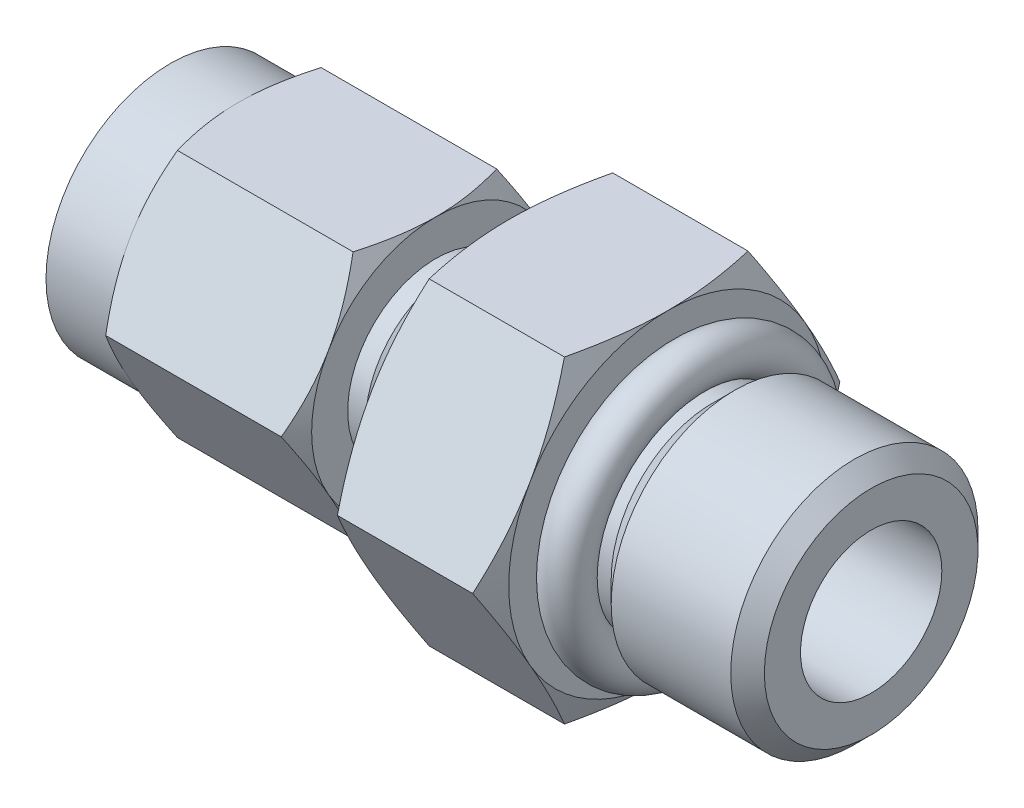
ISO-10303-21;
HEADER;
FILE_DESCRIPTION(('STEP AP214'),'2;1');
FILE_NAME('part.step','',(''),(''),'','','');
FILE_SCHEMA(('AUTOMOTIVE_DESIGN { 1 0 10303 214 1 1 1 1 }'));
ENDSEC;
DATA;
#1=APPLICATION_CONTEXT('core data for automotive mechanical design processes');
#2=APPLICATION_PROTOCOL_DEFINITION('international standard','automotive_design',2000,#1);
#3=PRODUCT_CONTEXT('',#1,'mechanical');
#4=PRODUCT('Part','Part','',(#3));
#5=PRODUCT_RELATED_PRODUCT_CATEGORY('part','',(#4));
#6=PRODUCT_DEFINITION_FORMATION('','',#4);
#7=PRODUCT_DEFINITION_CONTEXT('part definition',#1,'design');
#8=PRODUCT_DEFINITION('design','',#6,#7);
#9=PRODUCT_DEFINITION_SHAPE('','',#8);
#10=(LENGTH_UNIT() NAMED_UNIT(*) SI_UNIT(.MILLI.,.METRE.));
#11=(NAMED_UNIT(*) PLANE_ANGLE_UNIT() SI_UNIT($,.RADIAN.));
#12=(NAMED_UNIT(*) SI_UNIT($,.STERADIAN.) SOLID_ANGLE_UNIT());
#13=UNCERTAINTY_MEASURE_WITH_UNIT(LENGTH_MEASURE(1.E-05),#10,'distance_accuracy_value','');
#14=(GEOMETRIC_REPRESENTATION_CONTEXT(3) GLOBAL_UNCERTAINTY_ASSIGNED_CONTEXT((#13)) GLOBAL_UNIT_ASSIGNED_CONTEXT((#10,
#11,#12)) REPRESENTATION_CONTEXT('',''));
#15=CARTESIAN_POINT('',(0.,0.,0.));
#16=DIRECTION('',(0.,0.,1.));
#17=DIRECTION('',(1.,0.,0.));
#18=AXIS2_PLACEMENT_3D('',#15,#16,#17);
#19=CARTESIAN_POINT('',(-19.558,-5.588,3.22623330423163));
#20=DIRECTION('',(0.,-1.,0.));
#21=DIRECTION('',(0.,0.,-1.));
#22=AXIS2_PLACEMENT_3D('',#19,#20,#21);
#23=PLANE('',#22);
#24=DIRECTION('',(1.,0.,0.));
#25=VECTOR('',#24,1.);
#26=CARTESIAN_POINT('',(-19.558,-5.588,3.22623330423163));
#27=LINE('',#26,#25);
#28=CARTESIAN_POINT('',(-27.9488999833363,-5.58799996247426,3.22623332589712));
#29=VERTEX_POINT('',#28);
#30=CARTESIAN_POINT('',(-20.057100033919,-5.588,3.22623332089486));
#31=VERTEX_POINT('',#30);
#32=EDGE_CURVE('E219',#29,#31,#27,.T.);
#33=ORIENTED_EDGE('',*,*,#32,.F.);
#34=CARTESIAN_POINT('',(-27.9488999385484,-5.58799996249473,3.22623333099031));
#35=CARTESIAN_POINT('',(-28.024729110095,-5.58799998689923,2.96361931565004));
#36=CARTESIAN_POINT('',(-28.0942018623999,-5.58799999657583,2.69890219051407));
#37=CARTESIAN_POINT('',(-28.2167158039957,-5.58800000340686,2.16713448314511));
#38=CARTESIAN_POINT('',(-28.2698382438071,-5.58800000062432,1.90010244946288));
#39=CARTESIAN_POINT('',(-28.3350635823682,-5.58799999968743,1.49703426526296));
#40=CARTESIAN_POINT('',(-28.3544035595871,-5.58799999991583,1.36216904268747));
#41=CARTESIAN_POINT('',(-28.3878814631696,-5.58800000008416,1.09179294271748));
#42=CARTESIAN_POINT('',(-28.4020195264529,-5.5880000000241,0.956282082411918));
#43=CARTESIAN_POINT('',(-28.4248451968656,-5.58799999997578,0.68411346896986));
#44=CARTESIAN_POINT('',(-28.433505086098,-5.58799999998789,0.547453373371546));
#45=CARTESIAN_POINT('',(-28.4450944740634,-5.58800000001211,0.273864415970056));
#46=CARTESIAN_POINT('',(-28.4480228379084,-5.58800000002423,0.136935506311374));
#47=CARTESIAN_POINT('',(-28.4479999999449,-5.588,-9.45380304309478E-13));
#48=B_SPLINE_CURVE_WITH_KNOTS('',3,(#34,#35,#36,#37,#38,#39,#40,#41,#42,#43,#44,#45,#46,#47),
.UNSPECIFIED.,.F.,.F.,(4,2,2,2,2,2,4),(0.,0.820359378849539,1.63657370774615,2.04521639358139,
2.45384832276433,2.86453160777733,3.27529620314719),.UNSPECIFIED.);
#49=CARTESIAN_POINT('',(-28.4479999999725,-5.588,0.));
#50=VERTEX_POINT('',#49);
#51=EDGE_CURVE('E1439',#29,#50,#48,.T.);
#52=ORIENTED_EDGE('',*,*,#51,.T.);
#53=CARTESIAN_POINT('',(-28.4479999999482,-5.58800000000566,0.));
#54=CARTESIAN_POINT('',(-28.4480228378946,-5.58800000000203,-0.136935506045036));
#55=CARTESIAN_POINT('',(-28.4450944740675,-5.58800000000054,-0.273864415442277));
#56=CARTESIAN_POINT('',(-28.4335050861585,-5.58799999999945,-0.54745337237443));
#57=CARTESIAN_POINT('',(-28.4248451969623,-5.58799999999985,-0.684113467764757));
#58=CARTESIAN_POINT('',(-28.4020195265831,-5.58800000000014,-0.956282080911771));
#59=CARTESIAN_POINT('',(-28.3878814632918,-5.58800000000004,-1.09179294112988));
#60=CARTESIAN_POINT('',(-28.3544035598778,-5.58799999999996,-1.36216904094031));
#61=CARTESIAN_POINT('',(-28.3350635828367,-5.58799999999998,-1.49703426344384));
#62=CARTESIAN_POINT('',(-28.2698382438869,-5.58800000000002,-1.90010244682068));
#63=CARTESIAN_POINT('',(-28.2167158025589,-5.58800000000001,-2.16713447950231));
#64=CARTESIAN_POINT('',(-28.0942018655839,-5.58799999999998,-2.69890218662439));
#65=CARTESIAN_POINT('',(-28.0247291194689,-5.58799999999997,-2.96361931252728));
#66=CARTESIAN_POINT('',(-27.9488999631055,-5.588,-3.22623333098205));
#67=B_SPLINE_CURVE_WITH_KNOTS('',3,(#53,#54,#55,#56,#57,#58,#59,#60,#61,#62,#63,#64,#65,#66),
.UNSPECIFIED.,.F.,.F.,(4,2,2,2,2,2,4),(0.,0.41076459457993,0.821447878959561,1.23007980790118,
1.63872249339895,2.45493682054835,3.27529619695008),.UNSPECIFIED.);
#68=CARTESIAN_POINT('',(-27.9488999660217,-5.588,-3.22623332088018));
#69=VERTEX_POINT('',#68);
#70=EDGE_CURVE('E348',#50,#69,#67,.T.);
#71=ORIENTED_EDGE('',*,*,#70,.T.);
#72=DIRECTION('',(1.,0.,0.));
#73=VECTOR('',#72,1.);
#74=CARTESIAN_POINT('',(-19.558,-5.58799999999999,-3.22623330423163));
#75=LINE('',#74,#73);
#76=CARTESIAN_POINT('',(-20.0571000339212,-5.58800001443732,-3.22623329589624));
#77=VERTEX_POINT('',#76);
#78=EDGE_CURVE('E233',#77,#69,#75,.F.);
#79=ORIENTED_EDGE('',*,*,#78,.F.);
#80=CARTESIAN_POINT('',(-20.0571000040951,-5.588,-3.22623321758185));
#81=CARTESIAN_POINT('',(-19.9812708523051,-5.588,-2.96361920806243));
#82=CARTESIAN_POINT('',(-19.9117981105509,-5.588,-2.69890209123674));
#83=CARTESIAN_POINT('',(-19.7892841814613,-5.588,-2.16713440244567));
#84=CARTESIAN_POINT('',(-19.7361617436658,-5.58799999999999,-1.90010237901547));
#85=CARTESIAN_POINT('',(-19.670936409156,-5.588,-1.49703420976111));
#86=CARTESIAN_POINT('',(-19.6515964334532,-5.588,-1.36216899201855));
#87=CARTESIAN_POINT('',(-19.6181185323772,-5.588,-1.09179290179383));
#88=CARTESIAN_POINT('',(-19.6039804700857,-5.588,-0.956282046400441));
#89=CARTESIAN_POINT('',(-19.5811548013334,-5.588,-0.684113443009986));
#90=CARTESIAN_POINT('',(-19.5724949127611,-5.588,-0.547453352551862));
#91=CARTESIAN_POINT('',(-19.5609055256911,-5.588,-0.273864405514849));
#92=CARTESIAN_POINT('',(-19.5579771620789,-5.588,-0.136935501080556));
#93=CARTESIAN_POINT('',(-19.5580000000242,-5.588,4.05574814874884E-13));
#94=B_SPLINE_CURVE_WITH_KNOTS('',3,(#80,#81,#82,#83,#84,#85,#86,#87,#88,#89,#90,#91,#92,#93),
.UNSPECIFIED.,.F.,.F.,(4,2,2,2,2,2,4),(0.,0.820359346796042,1.63657364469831,2.04521631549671,
2.45384822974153,2.86453149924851,3.27529607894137),.UNSPECIFIED.);
#95=CARTESIAN_POINT('',(-19.558000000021,-5.58799999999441,0.));
#96=VERTEX_POINT('',#95);
#97=EDGE_CURVE('E367',#77,#96,#94,.T.);
#98=ORIENTED_EDGE('',*,*,#97,.T.);
#99=CARTESIAN_POINT('',(-19.5580000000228,-5.58800000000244,0.));
#100=CARTESIAN_POINT('',(-19.5579771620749,-5.58800000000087,0.136935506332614));
#101=CARTESIAN_POINT('',(-19.5609055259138,-5.58800000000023,0.273864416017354));
#102=CARTESIAN_POINT('',(-19.5724949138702,-5.58799999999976,0.547453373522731));
#103=CARTESIAN_POINT('',(-19.581154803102,-5.58799999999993,0.684113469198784));
#104=CARTESIAN_POINT('',(-19.6039804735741,-5.58800000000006,0.956282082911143));
#105=CARTESIAN_POINT('',(-19.6181185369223,-5.58800000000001,1.09179294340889));
#106=CARTESIAN_POINT('',(-19.6515964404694,-5.58799999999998,1.36216904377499));
#107=CARTESIAN_POINT('',(-19.6709364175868,-5.58799999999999,1.49703426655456));
#108=CARTESIAN_POINT('',(-19.7361617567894,-5.58800000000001,1.90010245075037));
#109=CARTESIAN_POINT('',(-19.7892841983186,-5.588,2.1671344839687));
#110=CARTESIAN_POINT('',(-19.9117981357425,-5.58799999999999,2.69890219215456));
#111=CARTESIAN_POINT('',(-19.9812708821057,-5.58799999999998,2.96361931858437));
#112=CARTESIAN_POINT('',(-20.0571000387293,-5.588,3.22623333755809));
#113=B_SPLINE_CURVE_WITH_KNOTS('',3,(#99,#100,#101,#102,#103,#104,#105,#106,#107,#108,#109,#110,
#111,#112),.UNSPECIFIED.,.F.,.F.,(4,2,2,2,2,2,4),(0.,0.410764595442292,0.821447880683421,
1.23007981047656,1.63872249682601,2.45493682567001,3.27529620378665),.UNSPECIFIED.);
#114=EDGE_CURVE('E373',#96,#31,#113,.T.);
#115=ORIENTED_EDGE('',*,*,#114,.T.);
#116=EDGE_LOOP('',(#33,#52,#71,#79,#98,#115));
#117=FACE_BOUND('',#116,.T.);
#118=ADVANCED_FACE('F45',(#117),#23,.T.);
#119=CARTESIAN_POINT('',(-19.558,0.,6.45246660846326));
#120=DIRECTION('',(0.,-0.5,0.866025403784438));
#121=DIRECTION('',(0.,-0.866025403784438,-0.5));
#122=AXIS2_PLACEMENT_3D('',#119,#120,#121);
#123=PLANE('',#122);
#124=CARTESIAN_POINT('',(-19.5580000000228,-2.79400000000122,4.83934995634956));
#125=CARTESIAN_POINT('',(-19.5579771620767,-2.67541037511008,4.90781770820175));
#126=CARTESIAN_POINT('',(-19.5609055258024,-2.55682646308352,4.9762821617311));
#127=CARTESIAN_POINT('',(-19.5724949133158,-2.31989148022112,5.11307663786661));
#128=CARTESIAN_POINT('',(-19.5811548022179,-2.20154036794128,5.18140668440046));
#129=CARTESIAN_POINT('',(-19.6039804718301,-1.96583543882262,5.31749098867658));
#130=CARTESIAN_POINT('',(-19.61811853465,-1.84847959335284,5.38524641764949));
#131=CARTESIAN_POINT('',(-19.6515964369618,-1.61432702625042,5.52043446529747));
#132=CARTESIAN_POINT('',(-19.670936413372,-1.49753031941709,5.58786707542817));
#133=CARTESIAN_POINT('',(-19.7361617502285,-1.1484630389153,5.78940116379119));
#134=CARTESIAN_POINT('',(-19.789284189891,-0.917206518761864,5.92291717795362));
#135=CARTESIAN_POINT('',(-19.9117981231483,-0.456682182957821,6.18880102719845));
#136=CARTESIAN_POINT('',(-19.9812708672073,-0.227430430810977,6.32115958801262));
#137=CARTESIAN_POINT('',(-20.0571000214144,-2.30831393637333E-08,6.4524665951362));
#138=B_SPLINE_CURVE_WITH_KNOTS('',3,(#124,#125,#126,#127,#128,#129,#130,#131,#132,#133,#134,
#135,#136,#137),.UNSPECIFIED.,.F.,.F.,(4,2,2,2,2,2,4),(0.,0.410764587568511,0.821447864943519,
1.23007978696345,1.63872246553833,2.4549367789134,3.27529614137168),.UNSPECIFIED.);
#139=CARTESIAN_POINT('',(-19.558000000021,-2.79399999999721,4.8393499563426));
#140=VERTEX_POINT('',#139);
#141=CARTESIAN_POINT('',(-20.0571000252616,-1.15415716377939E-08,6.45246660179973));
#142=VERTEX_POINT('',#141);
#143=EDGE_CURVE('E222',#140,#142,#138,.T.);
#144=ORIENTED_EDGE('',*,*,#143,.T.);
#145=DIRECTION('',(1.,0.,0.));
#146=VECTOR('',#145,1.);
#147=CARTESIAN_POINT('',(-19.558,0.,6.45246660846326));
#148=LINE('',#147,#146);
#149=CARTESIAN_POINT('',(-27.9488999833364,3.75262214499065E-08,6.45246658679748));
#150=VERTEX_POINT('',#149);
#151=EDGE_CURVE('E207',#150,#142,#148,.T.);
#152=ORIENTED_EDGE('',*,*,#151,.F.);
#153=CARTESIAN_POINT('',(-27.9488999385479,4.19274187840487E-08,6.4524665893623));
#154=CARTESIAN_POINT('',(-28.0247291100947,-0.227430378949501,6.32115960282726));
#155=CARTESIAN_POINT('',(-28.0942018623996,-0.456682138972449,6.18880104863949));
#156=CARTESIAN_POINT('',(-28.2167158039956,-0.917206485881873,5.92291720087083));
#157=CARTESIAN_POINT('',(-28.269838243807,-1.1484630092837,5.78940118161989));
#158=CARTESIAN_POINT('',(-28.3350635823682,-1.49753029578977,5.58786708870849));
#159=CARTESIAN_POINT('',(-28.354403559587,-1.61432700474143,5.52043447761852));
#160=CARTESIAN_POINT('',(-28.3878814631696,-1.84847957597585,5.38524642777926));
#161=CARTESIAN_POINT('',(-28.4020195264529,-1.96583542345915,5.31749099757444));
#162=CARTESIAN_POINT('',(-28.4248451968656,-2.20154035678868,5.18140669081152));
#163=CARTESIAN_POINT('',(-28.433505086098,-2.31989147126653,5.11307664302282));
#164=CARTESIAN_POINT('',(-28.4450944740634,-2.55682645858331,4.97628216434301));
#165=CARTESIAN_POINT('',(-28.4480228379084,-2.67541037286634,4.90781770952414));
#166=CARTESIAN_POINT('',(-28.4479999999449,-2.79400000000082,4.83934995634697));
#167=B_SPLINE_CURVE_WITH_KNOTS('',3,(#153,#154,#155,#156,#157,#158,#159,#160,#161,#162,#163,
#164,#165,#166),.UNSPECIFIED.,.F.,.F.,(4,2,2,2,2,2,4),(0.,0.820359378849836,1.63657370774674,
2.04521639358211,2.45384832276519,2.86453160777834,3.27529620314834),.UNSPECIFIED.);
#168=CARTESIAN_POINT('',(-28.4479999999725,-2.794,4.83934995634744));
#169=VERTEX_POINT('',#168);
#170=EDGE_CURVE('E1426',#150,#169,#167,.T.);
#171=ORIENTED_EDGE('',*,*,#170,.T.);
#172=CARTESIAN_POINT('',(-28.4479999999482,-2.79400000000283,4.83934995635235));
#173=CARTESIAN_POINT('',(-28.4480228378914,-2.91258962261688,4.77088220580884));
#174=CARTESIAN_POINT('',(-28.4450944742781,-3.03117353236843,4.70241775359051));
#175=CARTESIAN_POINT('',(-28.4335050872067,-3.26810851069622,4.56562328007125));
#176=CARTESIAN_POINT('',(-28.4248451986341,-3.38645962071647,4.49729323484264));
#177=CARTESIAN_POINT('',(-28.4020195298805,-3.62216454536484,4.36120893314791));
#178=CARTESIAN_POINT('',(-28.3878814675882,-3.73952038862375,4.29345350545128));
#179=CARTESIAN_POINT('',(-28.3544035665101,-3.97367295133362,4.15826546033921));
#180=CARTESIAN_POINT('',(-28.335063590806,-4.09046965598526,4.09083285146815));
#181=CARTESIAN_POINT('',(-28.2698382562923,-4.43953693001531,3.88929876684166));
#182=CARTESIAN_POINT('',(-28.2167158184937,-4.67079344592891,3.75578275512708));
#183=CARTESIAN_POINT('',(-28.0942018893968,-5.13131777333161,3.48989891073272));
#184=CARTESIAN_POINT('',(-28.0247291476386,-5.36056952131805,3.35754035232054));
#185=CARTESIAN_POINT('',(-27.9488999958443,-5.5879999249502,3.22623334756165));
#186=B_SPLINE_CURVE_WITH_KNOTS('',3,(#172,#173,#174,#175,#176,#177,#178,#179,#180,#181,#182,
#183,#184,#185),.UNSPECIFIED.,.F.,.F.,(4,2,2,2,2,2,4),(0.,0.410764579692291,0.821447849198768,
1.23007976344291,1.63872243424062,2.45493673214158,3.27529607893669),.UNSPECIFIED.);
#187=EDGE_CURVE('E355',#169,#29,#186,.T.);
#188=ORIENTED_EDGE('',*,*,#187,.T.);
#189=ORIENTED_EDGE('',*,*,#32,.T.);
#190=CARTESIAN_POINT('',(-20.0571000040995,-5.58799992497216,3.22623334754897));
#191=CARTESIAN_POINT('',(-19.9812708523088,-5.36056952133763,3.35754035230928));
#192=CARTESIAN_POINT('',(-19.9117981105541,-5.13131777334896,3.48989891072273));
#193=CARTESIAN_POINT('',(-19.7892841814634,-4.67079344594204,3.75578275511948));
#194=CARTESIAN_POINT('',(-19.7361617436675,-4.43953693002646,3.88929876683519));
#195=CARTESIAN_POINT('',(-19.6709364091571,-4.09046965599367,4.09083285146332));
#196=CARTESIAN_POINT('',(-19.651596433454,-3.97367295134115,4.15826546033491));
#197=CARTESIAN_POINT('',(-19.6181185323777,-3.73952038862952,4.29345350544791));
#198=CARTESIAN_POINT('',(-19.6039804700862,-3.62216454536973,4.36120893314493));
#199=CARTESIAN_POINT('',(-19.5811548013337,-3.38645962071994,4.4972932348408));
#200=CARTESIAN_POINT('',(-19.5724949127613,-3.26810851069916,4.56562328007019));
#201=CARTESIAN_POINT('',(-19.5609055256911,-3.03117353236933,4.70241775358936));
#202=CARTESIAN_POINT('',(-19.5579771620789,-2.91258962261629,4.77088220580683));
#203=CARTESIAN_POINT('',(-19.5580000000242,-2.79399999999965,4.83934995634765));
#204=B_SPLINE_CURVE_WITH_KNOTS('',3,(#190,#191,#192,#193,#194,#195,#196,#197,#198,#199,#200,
#201,#202,#203),.UNSPECIFIED.,.F.,.F.,(4,2,2,2,2,2,4),(0.,0.820359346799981,1.63657364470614,
2.0452163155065,2.45384822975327,2.86453149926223,3.27529607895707),.UNSPECIFIED.);
#205=EDGE_CURVE('E225',#31,#140,#204,.T.);
#206=ORIENTED_EDGE('',*,*,#205,.T.);
#207=EDGE_LOOP('',(#144,#152,#171,#188,#189,#206));
#208=FACE_BOUND('',#207,.T.);
#209=ADVANCED_FACE('F223',(#208),#123,.T.);
#210=CARTESIAN_POINT('',(-19.558,5.588,3.22623330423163));
#211=DIRECTION('',(0.,0.5,0.866025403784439));
#212=DIRECTION('',(0.,-0.866025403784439,0.5));
#213=AXIS2_PLACEMENT_3D('',#210,#211,#212);
#214=PLANE('',#213);
#215=DIRECTION('',(1.,0.,0.));
#216=VECTOR('',#215,1.);
#217=CARTESIAN_POINT('',(-19.558,5.588,3.22623330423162));
#218=LINE('',#217,#216);
#219=CARTESIAN_POINT('',(-27.9488999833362,5.588,3.22623326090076));
#220=VERTEX_POINT('',#219);
#221=CARTESIAN_POINT('',(-20.057100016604,5.58799996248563,3.22623332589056));
#222=VERTEX_POINT('',#221);
#223=EDGE_CURVE('E218',#220,#222,#218,.T.);
#224=ORIENTED_EDGE('',*,*,#223,.F.);
#225=CARTESIAN_POINT('',(-27.9488999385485,5.58800000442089,3.22623325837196));
#226=CARTESIAN_POINT('',(-28.0247291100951,5.36056960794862,3.35754028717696));
#227=CARTESIAN_POINT('',(-28.0942018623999,5.13131785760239,3.4898988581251));
#228=CARTESIAN_POINT('',(-28.2167158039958,4.67079351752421,3.75578271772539));
#229=CARTESIAN_POINT('',(-28.2698382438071,4.43953699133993,3.88929873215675));
#230=CARTESIAN_POINT('',(-28.3350635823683,4.09046970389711,4.09083282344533));
#231=CARTESIAN_POINT('',(-28.3544035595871,3.97367299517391,4.15826543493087));
#232=CARTESIAN_POINT('',(-28.3878814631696,3.73952042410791,4.29345348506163));
#233=CARTESIAN_POINT('',(-28.4020195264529,3.62216457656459,4.36120891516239));
#234=CARTESIAN_POINT('',(-28.4248451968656,3.38645964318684,4.49729322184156));
#235=CARTESIAN_POINT('',(-28.433505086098,3.26810852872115,4.5656232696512));
#236=CARTESIAN_POINT('',(-28.4450944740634,3.0311735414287,4.70241774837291));
#237=CARTESIAN_POINT('',(-28.4480228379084,2.91258962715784,4.77088220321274));
#238=CARTESIAN_POINT('',(-28.4479999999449,2.79399999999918,4.83934995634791));
#239=B_SPLINE_CURVE_WITH_KNOTS('',3,(#225,#226,#227,#228,#229,#230,#231,#232,#233,#234,#235,
#236,#237,#238),.UNSPECIFIED.,.F.,.F.,(4,2,2,2,2,2,4),(0.,0.820359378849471,1.63657370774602,
2.04521639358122,2.45384832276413,2.86453160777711,3.27529620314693),.UNSPECIFIED.);
#240=CARTESIAN_POINT('',(-28.4479999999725,2.794,4.83934995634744));
#241=VERTEX_POINT('',#240);
#242=EDGE_CURVE('E258',#220,#241,#239,.T.);
#243=ORIENTED_EDGE('',*,*,#242,.T.);
#244=CARTESIAN_POINT('',(-28.4479999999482,2.79400000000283,4.83934995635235));
#245=CARTESIAN_POINT('',(-28.4480228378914,2.67541037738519,4.90781770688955));
#246=CARTESIAN_POINT('',(-28.4450944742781,2.5568264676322,4.97628215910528));
#247=CARTESIAN_POINT('',(-28.4335050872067,2.31989148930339,5.11307663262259));
#248=CARTESIAN_POINT('',(-28.4248451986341,2.20154037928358,5.18140667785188));
#249=CARTESIAN_POINT('',(-28.4020195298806,1.96583545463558,5.31749097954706));
#250=CARTESIAN_POINT('',(-28.3878814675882,1.84847961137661,5.38524640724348));
#251=CARTESIAN_POINT('',(-28.3544035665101,1.61432704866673,5.52043445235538));
#252=CARTESIAN_POINT('',(-28.3350635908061,1.49753034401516,5.58786706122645));
#253=CARTESIAN_POINT('',(-28.2698382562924,1.14846306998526,5.78940114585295));
#254=CARTESIAN_POINT('',(-28.2167158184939,0.917206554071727,5.92291715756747));
#255=CARTESIAN_POINT('',(-28.0942018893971,0.456682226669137,6.18880100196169));
#256=CARTESIAN_POINT('',(-28.0247291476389,0.227430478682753,6.32115956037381));
#257=CARTESIAN_POINT('',(-27.9488999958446,7.50507088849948E-08,6.45246656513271));
#258=B_SPLINE_CURVE_WITH_KNOTS('',3,(#244,#245,#246,#247,#248,#249,#250,#251,#252,#253,#254,
#255,#256,#257),.UNSPECIFIED.,.F.,.F.,(4,2,2,2,2,2,4),(0.,0.410764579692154,0.821447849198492,
1.2300797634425,1.63872243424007,2.45493673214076,3.2752960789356),.UNSPECIFIED.);
#259=EDGE_CURVE('E214',#241,#150,#258,.T.);
#260=ORIENTED_EDGE('',*,*,#259,.T.);
#261=ORIENTED_EDGE('',*,*,#151,.T.);
#262=CARTESIAN_POINT('',(-20.0571000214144,2.3083135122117E-08,6.4524665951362));
#263=CARTESIAN_POINT('',(-19.9812708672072,0.227430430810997,6.32115958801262));
#264=CARTESIAN_POINT('',(-19.9117981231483,0.456682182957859,6.18880102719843));
#265=CARTESIAN_POINT('',(-19.789284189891,0.917206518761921,5.92291717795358));
#266=CARTESIAN_POINT('',(-19.7361617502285,1.14846303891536,5.78940116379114));
#267=CARTESIAN_POINT('',(-19.6709364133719,1.49753031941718,5.58786707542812));
#268=CARTESIAN_POINT('',(-19.6515964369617,1.61432702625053,5.52043446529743));
#269=CARTESIAN_POINT('',(-19.61811853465,1.84847959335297,5.38524641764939));
#270=CARTESIAN_POINT('',(-19.6039804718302,1.96583543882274,5.31749098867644));
#271=CARTESIAN_POINT('',(-19.5811548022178,2.2015403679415,5.18140668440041));
#272=CARTESIAN_POINT('',(-19.5724949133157,2.31989148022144,5.11307663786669));
#273=CARTESIAN_POINT('',(-19.5609055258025,2.55682646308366,4.97628216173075));
#274=CARTESIAN_POINT('',(-19.5579771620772,2.67541037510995,4.90781770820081));
#275=CARTESIAN_POINT('',(-19.5580000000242,2.79400000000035,4.83934995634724));
#276=B_SPLINE_CURVE_WITH_KNOTS('',3,(#262,#263,#264,#265,#266,#267,#268,#269,#270,#271,#272,
#273,#274,#275),.UNSPECIFIED.,.F.,.F.,(4,2,2,2,2,2,4),(0.,0.820359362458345,1.63657367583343,
2.04521635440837,2.45384827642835,2.86453155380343,3.27529614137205),.UNSPECIFIED.);
#277=CARTESIAN_POINT('',(-19.558000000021,2.79399999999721,4.8393499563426));
#278=VERTEX_POINT('',#277);
#279=EDGE_CURVE('E211',#142,#278,#276,.T.);
#280=ORIENTED_EDGE('',*,*,#279,.T.);
#281=CARTESIAN_POINT('',(-19.5580000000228,2.79400000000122,4.83934995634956));
#282=CARTESIAN_POINT('',(-19.5579771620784,2.91258962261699,4.77088220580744));
#283=CARTESIAN_POINT('',(-19.560905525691,3.03117353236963,4.70241775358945));
#284=CARTESIAN_POINT('',(-19.5724949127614,3.26810851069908,4.56562328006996));
#285=CARTESIAN_POINT('',(-19.5811548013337,3.38645962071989,4.49729323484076));
#286=CARTESIAN_POINT('',(-19.6039804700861,3.62216454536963,4.36120893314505));
#287=CARTESIAN_POINT('',(-19.6181185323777,3.73952038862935,4.29345350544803));
#288=CARTESIAN_POINT('',(-19.651596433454,3.97367295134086,4.15826546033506));
#289=CARTESIAN_POINT('',(-19.670936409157,4.09046965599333,4.09083285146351));
#290=CARTESIAN_POINT('',(-19.7361617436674,4.439536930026,3.88929876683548));
#291=CARTESIAN_POINT('',(-19.7892841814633,4.67079344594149,3.7557827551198));
#292=CARTESIAN_POINT('',(-19.9117981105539,5.13131777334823,3.48989891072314));
#293=CARTESIAN_POINT('',(-19.9812708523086,5.3605695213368,3.35754035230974));
#294=CARTESIAN_POINT('',(-20.0571000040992,5.58799992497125,3.2262333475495));
#295=B_SPLINE_CURVE_WITH_KNOTS('',3,(#281,#282,#283,#284,#285,#286,#287,#288,#289,#290,#291,
#292,#293,#294),.UNSPECIFIED.,.F.,.F.,(4,2,2,2,2,2,4),(0.,0.410764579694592,0.821447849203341,
1.23007976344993,1.6387224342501,2.45493673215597,3.27529607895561),.UNSPECIFIED.);
#296=EDGE_CURVE('E274',#278,#222,#295,.T.);
#297=ORIENTED_EDGE('',*,*,#296,.T.);
#298=EDGE_LOOP('',(#224,#243,#260,#261,#280,#297));
#299=FACE_BOUND('',#298,.T.);
#300=ADVANCED_FACE('F209',(#299),#214,.T.);
#301=CARTESIAN_POINT('',(-19.558,5.588,0.));
#302=DIRECTION('',(0.,1.,0.));
#303=DIRECTION('',(0.,0.,1.));
#304=AXIS2_PLACEMENT_3D('',#301,#302,#303);
#305=PLANE('',#304);
#306=DIRECTION('',(1.,0.,0.));
#307=VECTOR('',#306,1.);
#308=CARTESIAN_POINT('',(-19.558,5.588,-3.22623330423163));
#309=LINE('',#308,#307);
#310=CARTESIAN_POINT('',(-27.9488999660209,5.58800001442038,-3.22623329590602));
#311=VERTEX_POINT('',#310);
#312=CARTESIAN_POINT('',(-20.057100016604,5.588,-3.22623326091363));
#313=VERTEX_POINT('',#312);
#314=EDGE_CURVE('E645',#311,#313,#309,.T.);
#315=ORIENTED_EDGE('',*,*,#314,.F.);
#316=CARTESIAN_POINT('',(-27.9488999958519,5.58800000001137,-3.22623321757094));
#317=CARTESIAN_POINT('',(-28.0247291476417,5.58800000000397,-2.96361920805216));
#318=CARTESIAN_POINT('',(-28.094201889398,5.58800000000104,-2.69890209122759));
#319=CARTESIAN_POINT('',(-28.2167158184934,5.58799999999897,-2.16713440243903));
#320=CARTESIAN_POINT('',(-28.2698382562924,5.58799999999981,-1.90010237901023));
#321=CARTESIAN_POINT('',(-28.3350635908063,5.58800000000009,-1.49703420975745));
#322=CARTESIAN_POINT('',(-28.3544035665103,5.58800000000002,-1.3621689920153));
#323=CARTESIAN_POINT('',(-28.3878814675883,5.58799999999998,-1.09179290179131));
#324=CARTESIAN_POINT('',(-28.4020195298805,5.58799999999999,-0.956282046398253));
#325=CARTESIAN_POINT('',(-28.4248451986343,5.58800000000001,-0.684113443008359));
#326=CARTESIAN_POINT('',(-28.4335050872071,5.588,-0.547453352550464));
#327=CARTESIAN_POINT('',(-28.4450944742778,5.588,-0.273864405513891));
#328=CARTESIAN_POINT('',(-28.4480228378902,5.58799999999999,-0.136935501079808));
#329=CARTESIAN_POINT('',(-28.4479999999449,5.588,9.42466446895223E-13));
#330=B_SPLINE_CURVE_WITH_KNOTS('',3,(#316,#317,#318,#319,#320,#321,#322,#323,#324,#325,#326,
#327,#328,#329),.UNSPECIFIED.,.F.,.F.,(4,2,2,2,2,2,4),(0.,0.82035934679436,1.63657364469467,
2.04521631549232,2.45384822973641,2.86453149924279,3.27529607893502),.UNSPECIFIED.);
#331=CARTESIAN_POINT('',(-28.4479999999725,5.588,0.));
#332=VERTEX_POINT('',#331);
#333=EDGE_CURVE('E1417',#311,#332,#330,.T.);
#334=ORIENTED_EDGE('',*,*,#333,.T.);
#335=CARTESIAN_POINT('',(-28.4479999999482,5.58800000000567,0.));
#336=CARTESIAN_POINT('',(-28.4480228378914,5.58800000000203,0.136935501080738));
#337=CARTESIAN_POINT('',(-28.4450944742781,5.58800000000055,0.273864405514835));
#338=CARTESIAN_POINT('',(-28.4335050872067,5.58799999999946,0.547453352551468));
#339=CARTESIAN_POINT('',(-28.4248451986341,5.58799999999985,0.684113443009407));
#340=CARTESIAN_POINT('',(-28.4020195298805,5.58800000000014,0.956282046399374));
#341=CARTESIAN_POINT('',(-28.3878814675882,5.58800000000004,1.09179290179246));
#342=CARTESIAN_POINT('',(-28.3544035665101,5.58799999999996,1.36216899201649));
#343=CARTESIAN_POINT('',(-28.335063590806,5.58799999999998,1.49703420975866));
#344=CARTESIAN_POINT('',(-28.2698382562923,5.58800000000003,1.90010237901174));
#345=CARTESIAN_POINT('',(-28.2167158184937,5.58800000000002,2.16713440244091));
#346=CARTESIAN_POINT('',(-28.0942018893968,5.58799999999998,2.69890209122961));
#347=CARTESIAN_POINT('',(-28.0247291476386,5.58799999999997,2.96361920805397));
#348=CARTESIAN_POINT('',(-27.9488999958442,5.588,3.22623321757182));
#349=B_SPLINE_CURVE_WITH_KNOTS('',3,(#335,#336,#337,#338,#339,#340,#341,#342,#343,#344,#345,
#346,#347,#348),.UNSPECIFIED.,.F.,.F.,(4,2,2,2,2,2,4),(0.,0.410764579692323,0.821447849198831,
1.230079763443,1.63872243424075,2.45493673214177,3.27529607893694),.UNSPECIFIED.);
#350=EDGE_CURVE('E1424',#332,#220,#349,.T.);
#351=ORIENTED_EDGE('',*,*,#350,.T.);
#352=ORIENTED_EDGE('',*,*,#223,.T.);
#353=CARTESIAN_POINT('',(-20.0571000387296,5.588,3.22623333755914));
#354=CARTESIAN_POINT('',(-19.9812708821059,5.588,2.96361931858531));
#355=CARTESIAN_POINT('',(-19.9117981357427,5.588,2.6989021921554));
#356=CARTESIAN_POINT('',(-19.7892841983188,5.588,2.16713448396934));
#357=CARTESIAN_POINT('',(-19.7361617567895,5.588,1.90010245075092));
#358=CARTESIAN_POINT('',(-19.6709364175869,5.588,1.49703426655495));
#359=CARTESIAN_POINT('',(-19.6515964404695,5.588,1.36216904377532));
#360=CARTESIAN_POINT('',(-19.6181185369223,5.588,1.09179294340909));
#361=CARTESIAN_POINT('',(-19.6039804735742,5.588,0.956282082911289));
#362=CARTESIAN_POINT('',(-19.581154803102,5.588,0.684113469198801));
#363=CARTESIAN_POINT('',(-19.5724949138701,5.588,0.547453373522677));
#364=CARTESIAN_POINT('',(-19.5609055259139,5.588,0.27386441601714));
#365=CARTESIAN_POINT('',(-19.5579771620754,5.588,0.13693550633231));
#366=CARTESIAN_POINT('',(-19.5580000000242,5.588,-4.06763630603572E-13));
#367=B_SPLINE_CURVE_WITH_KNOTS('',3,(#353,#354,#355,#356,#357,#358,#359,#360,#361,#362,#363,
#364,#365,#366),.UNSPECIFIED.,.F.,.F.,(4,2,2,2,2,2,4),(0.,0.820359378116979,1.63657370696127,
2.04521639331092,2.45384832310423,2.86453160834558,3.27529620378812),.UNSPECIFIED.);
#368=CARTESIAN_POINT('',(-19.558000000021,5.58799999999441,0.));
#369=VERTEX_POINT('',#368);
#370=EDGE_CURVE('E281',#222,#369,#367,.T.);
#371=ORIENTED_EDGE('',*,*,#370,.T.);
#372=CARTESIAN_POINT('',(-19.5580000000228,5.58800000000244,0.));
#373=CARTESIAN_POINT('',(-19.5579771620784,5.58800000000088,-0.136935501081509));
#374=CARTESIAN_POINT('',(-19.560905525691,5.58800000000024,-0.273864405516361));
#375=CARTESIAN_POINT('',(-19.5724949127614,5.58799999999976,-0.547453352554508));
#376=CARTESIAN_POINT('',(-19.5811548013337,5.58799999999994,-0.684113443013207));
#377=CARTESIAN_POINT('',(-19.6039804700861,5.58800000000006,-0.956282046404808));
#378=CARTESIAN_POINT('',(-19.6181185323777,5.58800000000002,-1.09179290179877));
#379=CARTESIAN_POINT('',(-19.651596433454,5.58799999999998,-1.36216899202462));
#380=CARTESIAN_POINT('',(-19.670936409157,5.58799999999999,-1.49703420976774));
#381=CARTESIAN_POINT('',(-19.7361617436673,5.58800000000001,-1.9001023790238));
#382=CARTESIAN_POINT('',(-19.7892841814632,5.58800000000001,-2.16713440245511));
#383=CARTESIAN_POINT('',(-19.9117981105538,5.58799999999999,-2.69890209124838));
#384=CARTESIAN_POINT('',(-19.9812708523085,5.58799999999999,-2.96361920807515));
#385=CARTESIAN_POINT('',(-20.0571000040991,5.588,-3.22623321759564));
#386=B_SPLINE_CURVE_WITH_KNOTS('',3,(#372,#373,#374,#375,#376,#377,#378,#379,#380,#381,#382,
#383,#384,#385),.UNSPECIFIED.,.F.,.F.,(4,2,2,2,2,2,4),(0.,0.410764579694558,0.821447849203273,
1.23007976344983,1.63872243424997,2.45493673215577,3.27529607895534),.UNSPECIFIED.);
#387=EDGE_CURVE('E310',#369,#313,#386,.T.);
#388=ORIENTED_EDGE('',*,*,#387,.T.);
#389=EDGE_LOOP('',(#315,#334,#351,#352,#371,#388));
#390=FACE_BOUND('',#389,.T.);
#391=ADVANCED_FACE('F251',(#390),#305,.T.);
#392=CARTESIAN_POINT('',(-19.558,0.,-6.45246660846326));
#393=DIRECTION('',(0.,0.5,-0.866025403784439));
#394=DIRECTION('',(0.,0.866025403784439,0.5));
#395=AXIS2_PLACEMENT_3D('',#392,#393,#394);
#396=PLANE('',#395);
#397=CARTESIAN_POINT('',(-19.5580000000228,2.79400000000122,-4.83934995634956));
#398=CARTESIAN_POINT('',(-19.5579771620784,2.67541037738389,-4.90781770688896));
#399=CARTESIAN_POINT('',(-19.560905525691,2.5568264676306,-4.97628215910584));
#400=CARTESIAN_POINT('',(-19.5724949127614,2.31989148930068,-5.11307663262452));
#401=CARTESIAN_POINT('',(-19.5811548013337,2.20154037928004,-5.18140667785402));
#402=CARTESIAN_POINT('',(-19.6039804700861,1.96583545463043,-5.31749097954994));
#403=CARTESIAN_POINT('',(-19.6181185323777,1.84847961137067,-5.38524640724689));
#404=CARTESIAN_POINT('',(-19.651596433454,1.61432704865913,-5.5204344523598));
#405=CARTESIAN_POINT('',(-19.670936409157,1.49753034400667,-5.58786706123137));
#406=CARTESIAN_POINT('',(-19.7361617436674,1.14846306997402,-5.78940114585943));
#407=CARTESIAN_POINT('',(-19.7892841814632,0.917206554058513,-5.92291715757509));
#408=CARTESIAN_POINT('',(-19.9117981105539,0.456682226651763,-6.18880100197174));
#409=CARTESIAN_POINT('',(-19.9812708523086,0.227430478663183,-6.32115956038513));
#410=CARTESIAN_POINT('',(-20.0571000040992,7.5028745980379E-08,-6.45246656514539));
#411=B_SPLINE_CURVE_WITH_KNOTS('',3,(#397,#398,#399,#400,#401,#402,#403,#404,#405,#406,#407,
#408,#409,#410),.UNSPECIFIED.,.F.,.F.,(4,2,2,2,2,2,4),(0.,0.410764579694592,0.821447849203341,
1.23007976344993,1.6387224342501,2.45493673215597,3.27529607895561),.UNSPECIFIED.);
#412=CARTESIAN_POINT('',(-19.558000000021,2.79399999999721,-4.8393499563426));
#413=VERTEX_POINT('',#412);
#414=CARTESIAN_POINT('',(-20.057100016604,3.75143729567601E-08,-6.45246658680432));
#415=VERTEX_POINT('',#414);
#416=EDGE_CURVE('E320',#413,#415,#411,.T.);
#417=ORIENTED_EDGE('',*,*,#416,.T.);
#418=DIRECTION('',(1.,0.,0.));
#419=VECTOR('',#418,1.);
#420=CARTESIAN_POINT('',(-19.558,0.,-6.45246660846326));
#421=LINE('',#420,#419);
#422=CARTESIAN_POINT('',(-27.9488999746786,-1.15528278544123E-08,-6.45246660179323));
#423=VERTEX_POINT('',#422);
#424=EDGE_CURVE('E234',#423,#415,#421,.T.);
#425=ORIENTED_EDGE('',*,*,#424,.F.);
#426=CARTESIAN_POINT('',(-27.9488999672,1.65645226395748E-08,-6.45246657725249));
#427=CARTESIAN_POINT('',(-28.0247291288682,0.227430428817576,-6.32115958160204));
#428=CARTESIAN_POINT('',(-28.0942018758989,0.45668218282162,-6.18880102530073));
#429=CARTESIAN_POINT('',(-28.2167158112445,0.917206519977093,-5.92291717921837));
#430=CARTESIAN_POINT('',(-28.2698382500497,1.14846303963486,-5.78940116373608));
#431=CARTESIAN_POINT('',(-28.3350635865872,1.49753031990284,-5.58786707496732));
#432=CARTESIAN_POINT('',(-28.3544035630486,1.61432702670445,-5.52043446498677));
#433=CARTESIAN_POINT('',(-28.3878814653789,1.84847959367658,-5.38524641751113));
#434=CARTESIAN_POINT('',(-28.4020195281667,1.9658354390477,-5.31749098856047));
#435=CARTESIAN_POINT('',(-28.4248451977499,2.20154036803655,-5.18140668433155));
#436=CARTESIAN_POINT('',(-28.4335050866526,2.31989148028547,-5.11307663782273));
#437=CARTESIAN_POINT('',(-28.4450944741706,2.556826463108,-4.97628216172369));
#438=CARTESIAN_POINT('',(-28.4480228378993,2.67541037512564,-4.90781770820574));
#439=CARTESIAN_POINT('',(-28.4479999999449,2.79400000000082,-4.83934995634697));
#440=B_SPLINE_CURVE_WITH_KNOTS('',3,(#426,#427,#428,#429,#430,#431,#432,#433,#434,#435,#436,
#437,#438,#439),.UNSPECIFIED.,.F.,.F.,(4,2,2,2,2,2,4),(0.,0.820359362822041,1.63657367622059,
2.04521635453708,2.45384827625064,2.86453155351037,3.27529614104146),.UNSPECIFIED.);
#441=CARTESIAN_POINT('',(-28.4479999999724,2.794,-4.83934995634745));
#442=VERTEX_POINT('',#441);
#443=EDGE_CURVE('E412',#423,#442,#440,.T.);
#444=ORIENTED_EDGE('',*,*,#443,.T.);
#445=CARTESIAN_POINT('',(-28.4479999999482,2.79400000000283,-4.83934995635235));
#446=CARTESIAN_POINT('',(-28.4480228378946,2.91258962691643,-4.77088220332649));
#447=CARTESIAN_POINT('',(-28.4450944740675,3.03117354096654,-4.70241774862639));
#448=CARTESIAN_POINT('',(-28.4335050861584,3.26810852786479,-4.56562327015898));
#449=CARTESIAN_POINT('',(-28.4248451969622,3.38645964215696,-4.49729322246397));
#450=CARTESIAN_POINT('',(-28.4020195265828,3.62216457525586,-4.36120891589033));
#451=CARTESIAN_POINT('',(-28.3878814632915,3.7395204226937,-4.29345348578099));
#452=CARTESIAN_POINT('',(-28.3544035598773,3.9736729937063,-4.15826543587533));
#453=CARTESIAN_POINT('',(-28.335063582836,4.09046970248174,-4.0908328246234));
#454=CARTESIAN_POINT('',(-28.269838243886,4.43953698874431,-3.88929873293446));
#455=CARTESIAN_POINT('',(-28.2167158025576,4.67079351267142,-3.75578271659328));
#456=CARTESIAN_POINT('',(-28.0942018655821,5.13131785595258,-3.48989886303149));
#457=CARTESIAN_POINT('',(-28.0247291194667,5.36056961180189,-3.35754030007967));
#458=CARTESIAN_POINT('',(-27.9488999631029,5.58800002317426,-3.22623329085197));
#459=B_SPLINE_CURVE_WITH_KNOTS('',3,(#445,#446,#447,#448,#449,#450,#451,#452,#453,#454,#455,
#456,#457,#458),.UNSPECIFIED.,.F.,.F.,(4,2,2,2,2,2,4),(0.,0.4107645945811,0.8214478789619,
1.23007980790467,1.6387224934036,2.4549368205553,3.27529619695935),.UNSPECIFIED.);
#460=EDGE_CURVE('E1412',#442,#311,#459,.T.);
#461=ORIENTED_EDGE('',*,*,#460,.T.);
#462=ORIENTED_EDGE('',*,*,#314,.T.);
#463=CARTESIAN_POINT('',(-20.0571000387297,5.5880000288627,-3.22623328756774));
#464=CARTESIAN_POINT('',(-19.981270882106,5.36056961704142,-3.35754029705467));
#465=CARTESIAN_POINT('',(-19.9117981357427,5.13131786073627,-3.48989886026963));
#466=CARTESIAN_POINT('',(-19.7892841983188,4.67079351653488,-3.75578271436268));
#467=CARTESIAN_POINT('',(-19.7361617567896,4.4395369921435,-3.88929873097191));
#468=CARTESIAN_POINT('',(-19.6709364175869,4.0904697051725,-4.0908328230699));
#469=CARTESIAN_POINT('',(-19.6515964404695,3.97367299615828,-4.15826543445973));
#470=CARTESIAN_POINT('',(-19.6181185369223,3.73952042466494,-4.29345348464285));
#471=CARTESIAN_POINT('',(-19.6039804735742,3.62216457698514,-4.36120891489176));
#472=CARTESIAN_POINT('',(-19.581154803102,3.38645964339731,-4.49729322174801));
#473=CARTESIAN_POINT('',(-19.5724949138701,3.26810852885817,-4.56562326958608));
#474=CARTESIAN_POINT('',(-19.5609055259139,3.03117354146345,-4.70241774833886));
#475=CARTESIAN_POINT('',(-19.5579771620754,2.91258962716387,-4.77088220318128));
#476=CARTESIAN_POINT('',(-19.5580000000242,2.79399999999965,-4.83934995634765));
#477=B_SPLINE_CURVE_WITH_KNOTS('',3,(#463,#464,#465,#466,#467,#468,#469,#470,#471,#472,#473,
#474,#475,#476),.UNSPECIFIED.,.F.,.F.,(4,2,2,2,2,2,4),(0.,0.820359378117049,1.63657370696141,
2.04521639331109,2.45384832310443,2.86453160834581,3.27529620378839),.UNSPECIFIED.);
#478=EDGE_CURVE('E282',#313,#413,#477,.T.);
#479=ORIENTED_EDGE('',*,*,#478,.T.);
#480=EDGE_LOOP('',(#417,#425,#444,#461,#462,#479));
#481=FACE_BOUND('',#480,.T.);
#482=ADVANCED_FACE('F328',(#481),#396,.T.);
#483=CARTESIAN_POINT('',(-19.558,-5.588,-3.22623330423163));
#484=DIRECTION('',(0.,-0.5,-0.866025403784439));
#485=DIRECTION('',(0.,0.866025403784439,-0.5));
#486=AXIS2_PLACEMENT_3D('',#483,#484,#485);
#487=PLANE('',#486);
#488=CARTESIAN_POINT('',(-19.5580000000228,-2.79400000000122,-4.83934995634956));
#489=CARTESIAN_POINT('',(-19.5579771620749,-2.91258962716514,-4.77088220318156));
#490=CARTESIAN_POINT('',(-19.5609055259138,-3.03117354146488,-4.70241774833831));
#491=CARTESIAN_POINT('',(-19.5724949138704,-3.26810852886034,-4.56562326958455));
#492=CARTESIAN_POINT('',(-19.5811548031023,-3.38645964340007,-4.49729322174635));
#493=CARTESIAN_POINT('',(-19.6039804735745,-3.62216457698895,-4.36120891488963));
#494=CARTESIAN_POINT('',(-19.6181185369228,-3.73952042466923,-4.29345348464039));
#495=CARTESIAN_POINT('',(-19.6515964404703,-3.97367299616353,-4.15826543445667));
#496=CARTESIAN_POINT('',(-19.6709364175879,-4.09046970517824,-4.09083282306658));
#497=CARTESIAN_POINT('',(-19.7361617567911,-4.43953699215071,-3.88929873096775));
#498=CARTESIAN_POINT('',(-19.7892841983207,-4.67079351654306,-3.75578271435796));
#499=CARTESIAN_POINT('',(-19.9117981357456,-5.13131786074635,-3.48989886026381));
#500=CARTESIAN_POINT('',(-19.9812708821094,-5.36056961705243,-3.35754029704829));
#501=CARTESIAN_POINT('',(-20.0571000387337,-5.58800002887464,-3.22623328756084));
#502=B_SPLINE_CURVE_WITH_KNOTS('',3,(#488,#489,#490,#491,#492,#493,#494,#495,#496,#497,#498,
#499,#500,#501),.UNSPECIFIED.,.F.,.F.,(4,2,2,2,2,2,4),(0.,0.410764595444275,0.821447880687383,
1.23007981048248,1.63872249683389,2.45493682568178,3.27529620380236),.UNSPECIFIED.);
#503=CARTESIAN_POINT('',(-19.558000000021,-2.7939999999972,-4.8393499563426));
#504=VERTEX_POINT('',#503);
#505=EDGE_CURVE('E372',#504,#77,#502,.T.);
#506=ORIENTED_EDGE('',*,*,#505,.T.);
#507=ORIENTED_EDGE('',*,*,#78,.T.);
#508=CARTESIAN_POINT('',(-27.9488999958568,-5.58799992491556,-3.22623334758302));
#509=CARTESIAN_POINT('',(-28.0247291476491,-5.36056952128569,-3.35754035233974));
#510=CARTESIAN_POINT('',(-28.0942018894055,-5.13131777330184,-3.48989891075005));
#511=CARTESIAN_POINT('',(-28.2167158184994,-4.67079344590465,-3.75578275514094));
#512=CARTESIAN_POINT('',(-28.2698382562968,-4.43953692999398,-3.88929876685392));
#513=CARTESIAN_POINT('',(-28.335063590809,-4.09046965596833,-4.09083285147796));
#514=CARTESIAN_POINT('',(-28.3544035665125,-3.97367295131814,-4.1582654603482));
#515=CARTESIAN_POINT('',(-28.3878814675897,-3.73952038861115,-4.29345350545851));
#516=CARTESIAN_POINT('',(-28.4020195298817,-3.62216454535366,-4.3612089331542));
#517=CARTESIAN_POINT('',(-28.4248451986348,-3.38645962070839,-4.49729323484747));
#518=CARTESIAN_POINT('',(-28.4335050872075,-3.26810851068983,-4.56562328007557));
#519=CARTESIAN_POINT('',(-28.4450944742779,-3.03117353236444,-4.70241775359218));
#520=CARTESIAN_POINT('',(-28.4480228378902,-2.91258962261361,-4.77088220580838));
#521=CARTESIAN_POINT('',(-28.4479999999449,-2.79399999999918,-4.83934995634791));
#522=B_SPLINE_CURVE_WITH_KNOTS('',3,(#508,#509,#510,#511,#512,#513,#514,#515,#516,#517,#518,
#519,#520,#521),.UNSPECIFIED.,.F.,.F.,(4,2,2,2,2,2,4),(0.,0.820359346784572,1.63657364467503,
2.04521631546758,2.45384822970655,2.86453149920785,3.27529607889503),.UNSPECIFIED.);
#523=CARTESIAN_POINT('',(-28.4479999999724,-2.794,-4.83934995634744));
#524=VERTEX_POINT('',#523);
#525=EDGE_CURVE('E342',#69,#524,#522,.T.);
#526=ORIENTED_EDGE('',*,*,#525,.T.);
#527=CARTESIAN_POINT('',(-28.4479999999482,-2.79400000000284,-4.83934995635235));
#528=CARTESIAN_POINT('',(-28.448022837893,-2.67541037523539,-4.90781770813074));
#529=CARTESIAN_POINT('',(-28.4450944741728,-2.55682646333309,-4.97628216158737));
#530=CARTESIAN_POINT('',(-28.4335050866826,-2.319891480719,-5.11307663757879));
#531=CARTESIAN_POINT('',(-28.4248451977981,-2.2015403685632,-5.18140668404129));
#532=CARTESIAN_POINT('',(-28.4020195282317,-1.96583543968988,-5.31749098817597));
#533=CARTESIAN_POINT('',(-28.3878814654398,-1.84847959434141,-5.38524641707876));
#534=CARTESIAN_POINT('',(-28.3544035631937,-1.61432702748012,-5.52043446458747));
#535=CARTESIAN_POINT('',(-28.3350635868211,-1.49753032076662,-5.587867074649));
#536=CARTESIAN_POINT('',(-28.2698382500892,-1.14846304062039,-5.78940116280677));
#537=CARTESIAN_POINT('',(-28.2167158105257,-0.917206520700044,-5.92291717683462));
#538=CARTESIAN_POINT('',(-28.0942018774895,-0.456682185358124,-6.18880102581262));
#539=CARTESIAN_POINT('',(-28.0247291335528,-0.227430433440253,-6.32115958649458));
#540=CARTESIAN_POINT('',(-27.9488999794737,-2.59380489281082E-08,-6.45246659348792));
#541=B_SPLINE_CURVE_WITH_KNOTS('',3,(#527,#528,#529,#530,#531,#532,#533,#534,#535,#536,#537,
#538,#539,#540),.UNSPECIFIED.,.F.,.F.,(4,2,2,2,2,2,4),(0.,0.410764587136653,0.821447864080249,
1.23007978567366,1.63872246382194,2.45493677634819,3.27529613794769),.UNSPECIFIED.);
#542=EDGE_CURVE('E334',#524,#423,#541,.T.);
#543=ORIENTED_EDGE('',*,*,#542,.T.);
#544=ORIENTED_EDGE('',*,*,#424,.T.);
#545=CARTESIAN_POINT('',(-20.0571000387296,2.88624767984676E-08,-6.45246662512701));
#546=CARTESIAN_POINT('',(-19.9812708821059,-0.227430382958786,-6.3211596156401));
#547=CARTESIAN_POINT('',(-19.9117981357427,-0.456682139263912,-6.18880105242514));
#548=CARTESIAN_POINT('',(-19.7892841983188,-0.917206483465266,-5.92291719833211));
#549=CARTESIAN_POINT('',(-19.7361617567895,-1.14846300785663,-5.7894011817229));
#550=CARTESIAN_POINT('',(-19.6709364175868,-1.4975302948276,-5.58786708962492));
#551=CARTESIAN_POINT('',(-19.6515964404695,-1.61432700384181,-5.5204344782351));
#552=CARTESIAN_POINT('',(-19.6181185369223,-1.84847957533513,-5.38524642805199));
#553=CARTESIAN_POINT('',(-19.6039804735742,-1.96583542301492,-5.31749099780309));
#554=CARTESIAN_POINT('',(-19.581154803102,-2.20154035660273,-5.18140669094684));
#555=CARTESIAN_POINT('',(-19.5724949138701,-2.31989147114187,-5.11307664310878));
#556=CARTESIAN_POINT('',(-19.5609055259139,-2.55682645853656,-4.97628216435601));
#557=CARTESIAN_POINT('',(-19.5579771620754,-2.67541037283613,-4.9078177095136));
#558=CARTESIAN_POINT('',(-19.5580000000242,-2.79400000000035,-4.83934995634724));
#559=B_SPLINE_CURVE_WITH_KNOTS('',3,(#545,#546,#547,#548,#549,#550,#551,#552,#553,#554,#555,
#556,#557,#558),.UNSPECIFIED.,.F.,.F.,(4,2,2,2,2,2,4),(0.,0.820359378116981,1.63657370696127,
2.04521639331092,2.45384832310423,2.86453160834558,3.27529620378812),.UNSPECIFIED.);
#560=EDGE_CURVE('E315',#415,#504,#559,.T.);
#561=ORIENTED_EDGE('',*,*,#560,.T.);
#562=EDGE_LOOP('',(#506,#507,#526,#543,#544,#561));
#563=FACE_BOUND('',#562,.T.);
#564=ADVANCED_FACE('F325',(#563),#487,.T.);
#565=CARTESIAN_POINT('',(-19.5580000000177,0.,0.));
#566=DIRECTION('',(-1.,0.,0.));
#567=DIRECTION('',(0.,0.,1.));
#568=AXIS2_PLACEMENT_3D('',#565,#566,#567);
#569=CONICAL_SURFACE('',#568,5.58799999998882,1.04719755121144);
#570=CARTESIAN_POINT('',(-19.5580000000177,0.,0.));
#571=DIRECTION('',(-1.,0.,0.));
#572=DIRECTION('',(0.,0.,1.));
#573=AXIS2_PLACEMENT_3D('',#570,#571,#572);
#574=CIRCLE('',#573,5.58799999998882);
#575=EDGE_CURVE('E231',#278,#140,#574,.F.);
#576=ORIENTED_EDGE('',*,*,#575,.F.);
#577=ORIENTED_EDGE('',*,*,#279,.F.);
#578=ORIENTED_EDGE('',*,*,#143,.F.);
#579=EDGE_LOOP('',(#576,#577,#578));
#580=FACE_BOUND('',#579,.T.);
#581=ADVANCED_FACE('F229',(#580),#569,.T.);
#582=CARTESIAN_POINT('',(-19.5580000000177,0.,0.));
#583=DIRECTION('',(-1.,0.,0.));
#584=DIRECTION('',(0.,0.,1.));
#585=AXIS2_PLACEMENT_3D('',#582,#583,#584);
#586=CONICAL_SURFACE('',#585,5.58799999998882,1.04719755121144);
#587=CARTESIAN_POINT('',(-19.5580000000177,0.,0.));
#588=DIRECTION('',(-1.,0.,0.));
#589=DIRECTION('',(0.,0.,1.));
#590=AXIS2_PLACEMENT_3D('',#587,#588,#589);
#591=CIRCLE('',#590,5.58799999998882);
#592=EDGE_CURVE('E401',#140,#96,#591,.F.);
#593=ORIENTED_EDGE('',*,*,#592,.F.);
#594=ORIENTED_EDGE('',*,*,#205,.F.);
#595=ORIENTED_EDGE('',*,*,#114,.F.);
#596=EDGE_LOOP('',(#593,#594,#595));
#597=FACE_BOUND('',#596,.T.);
#598=ADVANCED_FACE('F384',(#597),#586,.T.);
#599=CARTESIAN_POINT('',(-19.5580000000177,0.,0.));
#600=DIRECTION('',(-1.,0.,0.));
#601=DIRECTION('',(0.,0.,1.));
#602=AXIS2_PLACEMENT_3D('',#599,#600,#601);
#603=CONICAL_SURFACE('',#602,5.58799999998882,1.04719755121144);
#604=CARTESIAN_POINT('',(-19.5580000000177,0.,0.));
#605=DIRECTION('',(-1.,0.,0.));
#606=DIRECTION('',(0.,0.,1.));
#607=AXIS2_PLACEMENT_3D('',#604,#605,#606);
#608=CIRCLE('',#607,5.58799999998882);
#609=EDGE_CURVE('E404',#96,#504,#608,.F.);
#610=ORIENTED_EDGE('',*,*,#609,.F.);
#611=ORIENTED_EDGE('',*,*,#97,.F.);
#612=ORIENTED_EDGE('',*,*,#505,.F.);
#613=EDGE_LOOP('',(#610,#611,#612));
#614=FACE_BOUND('',#613,.T.);
#615=ADVANCED_FACE('F381',(#614),#603,.T.);
#616=CARTESIAN_POINT('',(-19.5580000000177,0.,0.));
#617=DIRECTION('',(-1.,0.,0.));
#618=DIRECTION('',(0.,0.,1.));
#619=AXIS2_PLACEMENT_3D('',#616,#617,#618);
#620=CONICAL_SURFACE('',#619,5.58799999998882,1.04719755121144);
#621=ORIENTED_EDGE('',*,*,#416,.F.);
#622=CARTESIAN_POINT('',(-19.5580000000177,0.,0.));
#623=DIRECTION('',(-1.,0.,0.));
#624=DIRECTION('',(0.,0.,1.));
#625=AXIS2_PLACEMENT_3D('',#622,#623,#624);
#626=CIRCLE('',#625,5.58799999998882);
#627=EDGE_CURVE('E415',#504,#413,#626,.F.);
#628=ORIENTED_EDGE('',*,*,#627,.F.);
#629=ORIENTED_EDGE('',*,*,#560,.F.);
#630=EDGE_LOOP('',(#621,#628,#629));
#631=FACE_BOUND('',#630,.T.);
#632=ADVANCED_FACE('F305',(#631),#620,.T.);
#633=CARTESIAN_POINT('',(-19.5580000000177,0.,0.));
#634=DIRECTION('',(-1.,0.,0.));
#635=DIRECTION('',(0.,0.,1.));
#636=AXIS2_PLACEMENT_3D('',#633,#634,#635);
#637=CONICAL_SURFACE('',#636,5.58799999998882,1.04719755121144);
#638=ORIENTED_EDGE('',*,*,#387,.F.);
#639=CARTESIAN_POINT('',(-19.5580000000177,0.,0.));
#640=DIRECTION('',(-1.,0.,0.));
#641=DIRECTION('',(0.,0.,1.));
#642=AXIS2_PLACEMENT_3D('',#639,#640,#641);
#643=CIRCLE('',#642,5.58799999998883);
#644=EDGE_CURVE('E418',#413,#369,#643,.F.);
#645=ORIENTED_EDGE('',*,*,#644,.F.);
#646=ORIENTED_EDGE('',*,*,#478,.F.);
#647=EDGE_LOOP('',(#638,#645,#646));
#648=FACE_BOUND('',#647,.T.);
#649=ADVANCED_FACE('F297',(#648),#637,.T.);
#650=CARTESIAN_POINT('',(-19.5580000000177,0.,0.));
#651=DIRECTION('',(-1.,0.,0.));
#652=DIRECTION('',(0.,0.,1.));
#653=AXIS2_PLACEMENT_3D('',#650,#651,#652);
#654=CONICAL_SURFACE('',#653,5.58799999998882,1.04719755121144);
#655=ORIENTED_EDGE('',*,*,#296,.F.);
#656=CARTESIAN_POINT('',(-19.5580000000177,0.,0.));
#657=DIRECTION('',(-1.,0.,0.));
#658=DIRECTION('',(0.,0.,1.));
#659=AXIS2_PLACEMENT_3D('',#656,#657,#658);
#660=CIRCLE('',#659,5.58799999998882);
#661=EDGE_CURVE('E410',#369,#278,#660,.F.);
#662=ORIENTED_EDGE('',*,*,#661,.F.);
#663=ORIENTED_EDGE('',*,*,#370,.F.);
#664=EDGE_LOOP('',(#655,#662,#663));
#665=FACE_BOUND('',#664,.T.);
#666=ADVANCED_FACE('F292',(#665),#654,.T.);
#667=CARTESIAN_POINT('',(-28.4480000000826,0.,0.));
#668=DIRECTION('',(1.,0.,0.));
#669=DIRECTION('',(0.,0.,-1.));
#670=AXIS2_PLACEMENT_3D('',#667,#668,#669);
#671=CONICAL_SURFACE('',#670,5.58799999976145,1.04719755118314);
#672=CARTESIAN_POINT('',(-28.448,0.,0.));
#673=DIRECTION('',(1.,0.,0.));
#674=DIRECTION('',(0.,0.,-1.));
#675=AXIS2_PLACEMENT_3D('',#672,#673,#674);
#676=CIRCLE('',#675,5.588);
#677=EDGE_CURVE('E421',#524,#50,#676,.F.);
#678=ORIENTED_EDGE('',*,*,#677,.F.);
#679=ORIENTED_EDGE('',*,*,#525,.F.);
#680=ORIENTED_EDGE('',*,*,#70,.F.);
#681=EDGE_LOOP('',(#678,#679,#680));
#682=FACE_BOUND('',#681,.T.);
#683=ADVANCED_FACE('F296',(#682),#671,.T.);
#684=CARTESIAN_POINT('',(-28.4480000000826,0.,0.));
#685=DIRECTION('',(1.,0.,0.));
#686=DIRECTION('',(0.,0.,-1.));
#687=AXIS2_PLACEMENT_3D('',#684,#685,#686);
#688=CONICAL_SURFACE('',#687,5.58799999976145,1.04719755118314);
#689=ORIENTED_EDGE('',*,*,#187,.F.);
#690=CARTESIAN_POINT('',(-28.448,0.,0.));
#691=DIRECTION('',(1.,0.,0.));
#692=DIRECTION('',(0.,0.,-1.));
#693=AXIS2_PLACEMENT_3D('',#690,#691,#692);
#694=CIRCLE('',#693,5.588);
#695=EDGE_CURVE('E636',#50,#169,#694,.F.);
#696=ORIENTED_EDGE('',*,*,#695,.F.);
#697=ORIENTED_EDGE('',*,*,#51,.F.);
#698=EDGE_LOOP('',(#689,#696,#697));
#699=FACE_BOUND('',#698,.T.);
#700=ADVANCED_FACE('F960',(#699),#688,.T.);
#701=CARTESIAN_POINT('',(-28.4480000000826,0.,0.));
#702=DIRECTION('',(1.,0.,0.));
#703=DIRECTION('',(0.,0.,-1.));
#704=AXIS2_PLACEMENT_3D('',#701,#702,#703);
#705=CONICAL_SURFACE('',#704,5.58799999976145,1.04719755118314);
#706=ORIENTED_EDGE('',*,*,#259,.F.);
#707=CARTESIAN_POINT('',(-28.448,0.,0.));
#708=DIRECTION('',(1.,0.,0.));
#709=DIRECTION('',(0.,0.,-1.));
#710=AXIS2_PLACEMENT_3D('',#707,#708,#709);
#711=CIRCLE('',#710,5.588);
#712=EDGE_CURVE('E633',#169,#241,#711,.F.);
#713=ORIENTED_EDGE('',*,*,#712,.F.);
#714=ORIENTED_EDGE('',*,*,#170,.F.);
#715=EDGE_LOOP('',(#706,#713,#714));
#716=FACE_BOUND('',#715,.T.);
#717=ADVANCED_FACE('F964',(#716),#705,.T.);
#718=CARTESIAN_POINT('',(-28.4480000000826,0.,0.));
#719=DIRECTION('',(1.,0.,0.));
#720=DIRECTION('',(0.,0.,-1.));
#721=AXIS2_PLACEMENT_3D('',#718,#719,#720);
#722=CONICAL_SURFACE('',#721,5.58799999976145,1.04719755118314);
#723=ORIENTED_EDGE('',*,*,#350,.F.);
#724=CARTESIAN_POINT('',(-28.448,0.,0.));
#725=DIRECTION('',(1.,0.,0.));
#726=DIRECTION('',(0.,0.,-1.));
#727=AXIS2_PLACEMENT_3D('',#724,#725,#726);
#728=CIRCLE('',#727,5.588);
#729=EDGE_CURVE('E630',#241,#332,#728,.F.);
#730=ORIENTED_EDGE('',*,*,#729,.F.);
#731=ORIENTED_EDGE('',*,*,#242,.F.);
#732=EDGE_LOOP('',(#723,#730,#731));
#733=FACE_BOUND('',#732,.T.);
#734=ADVANCED_FACE('F1005',(#733),#722,.T.);
#735=CARTESIAN_POINT('',(-28.4480000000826,0.,0.));
#736=DIRECTION('',(1.,0.,0.));
#737=DIRECTION('',(0.,0.,-1.));
#738=AXIS2_PLACEMENT_3D('',#735,#736,#737);
#739=CONICAL_SURFACE('',#738,5.58799999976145,1.04719755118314);
#740=CARTESIAN_POINT('',(-28.448,0.,0.));
#741=DIRECTION('',(1.,0.,0.));
#742=DIRECTION('',(0.,0.,-1.));
#743=AXIS2_PLACEMENT_3D('',#740,#741,#742);
#744=CIRCLE('',#743,5.588);
#745=EDGE_CURVE('E625',#332,#442,#744,.F.);
#746=ORIENTED_EDGE('',*,*,#745,.F.);
#747=ORIENTED_EDGE('',*,*,#333,.F.);
#748=ORIENTED_EDGE('',*,*,#460,.F.);
#749=EDGE_LOOP('',(#746,#747,#748));
#750=FACE_BOUND('',#749,.T.);
#751=ADVANCED_FACE('F997',(#750),#739,.T.);
#752=CARTESIAN_POINT('',(-28.4480000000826,0.,0.));
#753=DIRECTION('',(1.,0.,0.));
#754=DIRECTION('',(0.,0.,-1.));
#755=AXIS2_PLACEMENT_3D('',#752,#753,#754);
#756=CONICAL_SURFACE('',#755,5.58799999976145,1.04719755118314);
#757=ORIENTED_EDGE('',*,*,#542,.F.);
#758=CARTESIAN_POINT('',(-28.448,0.,0.));
#759=DIRECTION('',(1.,0.,0.));
#760=DIRECTION('',(0.,0.,-1.));
#761=AXIS2_PLACEMENT_3D('',#758,#759,#760);
#762=CIRCLE('',#761,5.588);
#763=EDGE_CURVE('E426',#442,#524,#762,.F.);
#764=ORIENTED_EDGE('',*,*,#763,.F.);
#765=ORIENTED_EDGE('',*,*,#443,.F.);
#766=EDGE_LOOP('',(#757,#764,#765));
#767=FACE_BOUND('',#766,.T.);
#768=ADVANCED_FACE('F994',(#767),#756,.T.);
#769=CARTESIAN_POINT('',(-19.558,0.,4.778375));
#770=DIRECTION('',(1.,0.,0.));
#771=DIRECTION('',(0.,1.,0.));
#772=AXIS2_PLACEMENT_3D('',#769,#770,#771);
#773=PLANE('',#772);
#774=CARTESIAN_POINT('',(-19.558,0.,0.));
#775=DIRECTION('',(1.,0.,0.));
#776=DIRECTION('',(0.,0.,-1.));
#777=AXIS2_PLACEMENT_3D('',#774,#775,#776);
#778=CIRCLE('',#777,3.96875);
#779=CARTESIAN_POINT('',(-19.558,0.,-3.96875));
#780=VERTEX_POINT('',#779);
#781=EDGE_CURVE('E422',#780,#780,#778,.T.);
#782=ORIENTED_EDGE('',*,*,#781,.F.);
#783=EDGE_LOOP('',(#782));
#784=FACE_BOUND('',#783,.T.);
#785=ORIENTED_EDGE('',*,*,#644,.T.);
#786=ORIENTED_EDGE('',*,*,#661,.T.);
#787=ORIENTED_EDGE('',*,*,#575,.T.);
#788=ORIENTED_EDGE('',*,*,#592,.T.);
#789=ORIENTED_EDGE('',*,*,#609,.T.);
#790=ORIENTED_EDGE('',*,*,#627,.T.);
#791=EDGE_LOOP('',(#785,#786,#787,#788,#789,#790));
#792=FACE_BOUND('',#791,.T.);
#793=ADVANCED_FACE('F408',(#784,#792),#773,.T.);
#794=CARTESIAN_POINT('',(-24.003,0.,0.));
#795=DIRECTION('',(1.,0.,0.));
#796=DIRECTION('',(0.,0.,-1.));
#797=AXIS2_PLACEMENT_3D('',#794,#795,#796);
#798=CYLINDRICAL_SURFACE('',#797,5.588);
#799=ORIENTED_EDGE('',*,*,#695,.T.);
#800=ORIENTED_EDGE('',*,*,#712,.T.);
#801=ORIENTED_EDGE('',*,*,#729,.T.);
#802=ORIENTED_EDGE('',*,*,#745,.T.);
#803=ORIENTED_EDGE('',*,*,#763,.T.);
#804=ORIENTED_EDGE('',*,*,#677,.T.);
#805=EDGE_LOOP('',(#799,#800,#801,#802,#803,#804));
#806=FACE_BOUND('',#805,.T.);
#807=CARTESIAN_POINT('',(-31.496,0.,0.));
#808=DIRECTION('',(1.,0.,0.));
#809=DIRECTION('',(0.,0.,-1.));
#810=AXIS2_PLACEMENT_3D('',#807,#808,#809);
#811=CIRCLE('',#810,5.588);
#812=CARTESIAN_POINT('',(-31.496,0.,-5.588));
#813=VERTEX_POINT('',#812);
#814=EDGE_CURVE('E425',#813,#813,#811,.F.);
#815=ORIENTED_EDGE('',*,*,#814,.F.);
#816=EDGE_LOOP('',(#815));
#817=FACE_BOUND('',#816,.T.);
#818=ADVANCED_FACE('F1141',(#806,#817),#798,.T.);
#819=CARTESIAN_POINT('',(-19.152235,0.,0.));
#820=DIRECTION('',(1.,0.,0.));
#821=DIRECTION('',(0.,0.,-1.));
#822=AXIS2_PLACEMENT_3D('',#819,#820,#821);
#823=CYLINDRICAL_SURFACE('',#822,3.96875);
#824=ORIENTED_EDGE('',*,*,#781,.T.);
#825=EDGE_LOOP('',(#824));
#826=FACE_BOUND('',#825,.T.);
#827=CARTESIAN_POINT('',(-18.7464699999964,0.,0.));
#828=DIRECTION('',(-1.,0.,0.));
#829=DIRECTION('',(0.,0.,1.));
#830=AXIS2_PLACEMENT_3D('',#827,#828,#829);
#831=CIRCLE('',#830,3.96875000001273);
#832=CARTESIAN_POINT('',(-18.7464699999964,0.,3.96875000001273));
#833=VERTEX_POINT('',#832);
#834=EDGE_CURVE('E429',#833,#833,#831,.F.);
#835=ORIENTED_EDGE('',*,*,#834,.F.);
#836=EDGE_LOOP('',(#835));
#837=FACE_BOUND('',#836,.T.);
#838=ADVANCED_FACE('F1152',(#826,#837),#823,.T.);
#839=CARTESIAN_POINT('',(-31.496,0.,2.794));
#840=DIRECTION('',(-1.,0.,0.));
#841=DIRECTION('',(0.,0.,1.));
#842=AXIS2_PLACEMENT_3D('',#839,#840,#841);
#843=PLANE('',#842);
#844=ORIENTED_EDGE('',*,*,#814,.T.);
#845=EDGE_LOOP('',(#844));
#846=FACE_BOUND('',#845,.T.);
#847=CARTESIAN_POINT('',(-31.496,0.,0.));
#848=DIRECTION('',(1.,0.,0.));
#849=DIRECTION('',(0.,0.,-1.));
#850=AXIS2_PLACEMENT_3D('',#847,#848,#849);
#851=CIRCLE('',#850,1.5875);
#852=CARTESIAN_POINT('',(-31.496,0.,-1.5875));
#853=VERTEX_POINT('',#852);
#854=EDGE_CURVE('E430',#853,#853,#851,.T.);
#855=ORIENTED_EDGE('',*,*,#854,.T.);
#856=EDGE_LOOP('',(#855));
#857=FACE_BOUND('',#856,.T.);
#858=ADVANCED_FACE('F1163',(#846,#857),#843,.T.);
#859=CARTESIAN_POINT('',(-18.7464699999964,0.,0.));
#860=DIRECTION('',(-1.,0.,0.));
#861=DIRECTION('',(0.,0.,1.));
#862=AXIS2_PLACEMENT_3D('',#859,#860,#861);
#863=CONICAL_SURFACE('',#862,3.96875000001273,0.785398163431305);
#864=ORIENTED_EDGE('',*,*,#834,.T.);
#865=EDGE_LOOP('',(#864));
#866=FACE_BOUND('',#865,.T.);
#867=CARTESIAN_POINT('',(-17.907,0.,0.));
#868=DIRECTION('',(1.,0.,0.));
#869=DIRECTION('',(0.,0.,-1.));
#870=AXIS2_PLACEMENT_3D('',#867,#868,#869);
#871=CIRCLE('',#870,3.12928);
#872=CARTESIAN_POINT('',(-17.907,0.,-3.12928));
#873=VERTEX_POINT('',#872);
#874=EDGE_CURVE('E433',#873,#873,#871,.T.);
#875=ORIENTED_EDGE('',*,*,#874,.F.);
#876=EDGE_LOOP('',(#875));
#877=FACE_BOUND('',#876,.T.);
#878=ADVANCED_FACE('F1174',(#866,#877),#863,.T.);
#879=CARTESIAN_POINT('',(-25.146,0.,0.));
#880=DIRECTION('',(1.,0.,0.));
#881=DIRECTION('',(0.,0.,-1.));
#882=AXIS2_PLACEMENT_3D('',#879,#880,#881);
#883=CYLINDRICAL_SURFACE('',#882,1.5875);
#884=CARTESIAN_POINT('',(-18.796,0.,0.));
#885=DIRECTION('',(1.,0.,0.));
#886=DIRECTION('',(0.,0.,-1.));
#887=AXIS2_PLACEMENT_3D('',#884,#885,#886);
#888=CIRCLE('',#887,1.5875);
#889=CARTESIAN_POINT('',(-18.796,0.,-1.5875));
#890=VERTEX_POINT('',#889);
#891=EDGE_CURVE('E434',#890,#890,#888,.T.);
#892=ORIENTED_EDGE('',*,*,#891,.T.);
#893=EDGE_LOOP('',(#892));
#894=FACE_BOUND('',#893,.T.);
#895=ORIENTED_EDGE('',*,*,#854,.F.);
#896=EDGE_LOOP('',(#895));
#897=FACE_BOUND('',#896,.T.);
#898=ADVANCED_FACE('F1185',(#894,#897),#883,.F.);
#899=CARTESIAN_POINT('',(-17.0815,0.,0.));
#900=DIRECTION('',(1.,0.,0.));
#901=DIRECTION('',(0.,0.,-1.));
#902=AXIS2_PLACEMENT_3D('',#899,#900,#901);
#903=CYLINDRICAL_SURFACE('',#902,3.12928);
#904=ORIENTED_EDGE('',*,*,#874,.T.);
#905=EDGE_LOOP('',(#904));
#906=FACE_BOUND('',#905,.T.);
#907=CARTESIAN_POINT('',(-16.256,0.,0.));
#908=DIRECTION('',(1.,0.,0.));
#909=DIRECTION('',(0.,0.,-1.));
#910=AXIS2_PLACEMENT_3D('',#907,#908,#909);
#911=CIRCLE('',#910,3.12928);
#912=CARTESIAN_POINT('',(-16.256,0.,-3.12928));
#913=VERTEX_POINT('',#912);
#914=EDGE_CURVE('E437',#913,#913,#911,.F.);
#915=ORIENTED_EDGE('',*,*,#914,.T.);
#916=EDGE_LOOP('',(#915));
#917=FACE_BOUND('',#916,.T.);
#918=ADVANCED_FACE('F1196',(#906,#917),#903,.T.);
#919=CARTESIAN_POINT('',(-18.796,0.,0.));
#920=DIRECTION('',(1.,0.,0.));
#921=DIRECTION('',(0.,0.,-1.));
#922=AXIS2_PLACEMENT_3D('',#919,#920,#921);
#923=PLANE('',#922);
#924=ORIENTED_EDGE('',*,*,#891,.F.);
#925=EDGE_LOOP('',(#924));
#926=FACE_BOUND('',#925,.T.);
#927=CARTESIAN_POINT('',(-18.796,0.,0.));
#928=DIRECTION('',(-1.,0.,0.));
#929=DIRECTION('',(0.,0.,1.));
#930=AXIS2_PLACEMENT_3D('',#927,#928,#929);
#931=CIRCLE('',#930,1.143);
#932=CARTESIAN_POINT('',(-18.796,0.,1.143));
#933=VERTEX_POINT('',#932);
#934=EDGE_CURVE('E440',#933,#933,#931,.F.);
#935=ORIENTED_EDGE('',*,*,#934,.T.);
#936=EDGE_LOOP('',(#935));
#937=FACE_BOUND('',#936,.T.);
#938=ADVANCED_FACE('F1207',(#926,#937),#923,.F.);
#939=CARTESIAN_POINT('',(-16.256,0.,0.));
#940=DIRECTION('',(1.,0.,0.));
#941=DIRECTION('',(0.,1.,0.));
#942=AXIS2_PLACEMENT_3D('',#939,#940,#941);
#943=PLANE('',#942);
#944=CARTESIAN_POINT('',(-16.256,0.,0.));
#945=DIRECTION('',(1.,0.,0.));
#946=DIRECTION('',(0.,0.,-1.));
#947=AXIS2_PLACEMENT_3D('',#944,#945,#946);
#948=CIRCLE('',#947,7.14375);
#949=CARTESIAN_POINT('',(-16.256,3.571875,6.18666897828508));
#950=VERTEX_POINT('',#949);
#951=CARTESIAN_POINT('',(-16.256,7.14375,0.));
#952=VERTEX_POINT('',#951);
#953=EDGE_CURVE('E447',#950,#952,#948,.F.);
#954=ORIENTED_EDGE('',*,*,#953,.T.);
#955=CARTESIAN_POINT('',(-16.256,0.,0.));
#956=DIRECTION('',(1.,0.,0.));
#957=DIRECTION('',(0.,0.,-1.));
#958=AXIS2_PLACEMENT_3D('',#955,#956,#957);
#959=CIRCLE('',#958,7.14375);
#960=CARTESIAN_POINT('',(-16.256,3.571875,-6.18666897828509));
#961=VERTEX_POINT('',#960);
#962=EDGE_CURVE('E445',#952,#961,#959,.F.);
#963=ORIENTED_EDGE('',*,*,#962,.T.);
#964=CARTESIAN_POINT('',(-16.256,0.,0.));
#965=DIRECTION('',(1.,0.,0.));
#966=DIRECTION('',(0.,0.,-1.));
#967=AXIS2_PLACEMENT_3D('',#964,#965,#966);
#968=CIRCLE('',#967,7.14375);
#969=CARTESIAN_POINT('',(-16.256,-3.57187500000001,-6.18666897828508));
#970=VERTEX_POINT('',#969);
#971=EDGE_CURVE('E443',#961,#970,#968,.F.);
#972=ORIENTED_EDGE('',*,*,#971,.T.);
#973=CARTESIAN_POINT('',(-16.256,0.,0.));
#974=DIRECTION('',(1.,0.,0.));
#975=DIRECTION('',(0.,0.,-1.));
#976=AXIS2_PLACEMENT_3D('',#973,#974,#975);
#977=CIRCLE('',#976,7.14375);
#978=CARTESIAN_POINT('',(-16.256,-7.14375,0.));
#979=VERTEX_POINT('',#978);
#980=EDGE_CURVE('E449',#970,#979,#977,.F.);
#981=ORIENTED_EDGE('',*,*,#980,.T.);
#982=CARTESIAN_POINT('',(-16.256,0.,0.));
#983=DIRECTION('',(1.,0.,0.));
#984=DIRECTION('',(0.,0.,-1.));
#985=AXIS2_PLACEMENT_3D('',#982,#983,#984);
#986=CIRCLE('',#985,7.14375);
#987=CARTESIAN_POINT('',(-16.256,-3.571875,6.18666897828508));
#988=VERTEX_POINT('',#987);
#989=EDGE_CURVE('E453',#979,#988,#986,.F.);
#990=ORIENTED_EDGE('',*,*,#989,.T.);
#991=CARTESIAN_POINT('',(-16.256,0.,0.));
#992=DIRECTION('',(1.,0.,0.));
#993=DIRECTION('',(0.,0.,-1.));
#994=AXIS2_PLACEMENT_3D('',#991,#992,#993);
#995=CIRCLE('',#994,7.14375);
#996=EDGE_CURVE('E451',#988,#950,#995,.F.);
#997=ORIENTED_EDGE('',*,*,#996,.T.);
#998=EDGE_LOOP('',(#954,#963,#972,#981,#990,#997));
#999=FACE_BOUND('',#998,.T.);
#1000=ORIENTED_EDGE('',*,*,#914,.F.);
#1001=EDGE_LOOP('',(#1000));
#1002=FACE_BOUND('',#1001,.T.);
#1003=ADVANCED_FACE('F1218',(#999,#1002),#943,.F.);
#1004=CARTESIAN_POINT('',(-12.7,0.,0.));
#1005=DIRECTION('',(-1.,0.,0.));
#1006=DIRECTION('',(0.,0.,1.));
#1007=AXIS2_PLACEMENT_3D('',#1004,#1005,#1006);
#1008=CYLINDRICAL_SURFACE('',#1007,1.143);
#1009=CARTESIAN_POINT('',(-8.89,0.,0.));
#1010=DIRECTION('',(-1.,0.,0.));
#1011=DIRECTION('',(0.,0.,1.));
#1012=AXIS2_PLACEMENT_3D('',#1009,#1010,#1011);
#1013=CIRCLE('',#1012,1.143);
#1014=CARTESIAN_POINT('',(-8.89,0.,1.143));
#1015=VERTEX_POINT('',#1014);
#1016=EDGE_CURVE('E49',#1015,#1015,#1013,.F.);
#1017=ORIENTED_EDGE('',*,*,#1016,.T.);
#1018=EDGE_LOOP('',(#1017));
#1019=FACE_BOUND('',#1018,.T.);
#1020=ORIENTED_EDGE('',*,*,#934,.F.);
#1021=EDGE_LOOP('',(#1020));
#1022=FACE_BOUND('',#1021,.T.);
#1023=ADVANCED_FACE('F1107',(#1019,#1022),#1008,.F.);
#1024=CARTESIAN_POINT('',(-16.256,0.,0.));
#1025=DIRECTION('',(1.,0.,0.));
#1026=DIRECTION('',(0.,0.,-1.));
#1027=AXIS2_PLACEMENT_3D('',#1024,#1025,#1026);
#1028=CONICAL_SURFACE('',#1027,7.14375,1.13446401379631);
#1029=ORIENTED_EDGE('',*,*,#971,.F.);
#1030=CARTESIAN_POINT('',(-15.7406638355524,0.,-8.24889197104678));
#1031=CARTESIAN_POINT('',(-15.8195905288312,0.293058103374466,-8.07969479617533));
#1032=CARTESIAN_POINT('',(-15.8916199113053,0.58769517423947,-7.90958600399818));
#1033=CARTESIAN_POINT('',(-16.0184120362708,1.17869518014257,-7.56837199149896));
#1034=CARTESIAN_POINT('',(-16.0732320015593,1.47504898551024,-7.39727204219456));
#1035=CARTESIAN_POINT('',(-16.1403575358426,1.92140845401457,-7.13956628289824));
#1036=CARTESIAN_POINT('',(-16.1602205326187,2.0705634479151,-7.0534516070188));
#1037=CARTESIAN_POINT('',(-16.1945639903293,2.36933901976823,-6.88095345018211));
#1038=CARTESIAN_POINT('',(-16.2090445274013,2.51895959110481,-6.79456997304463));
#1039=CARTESIAN_POINT('',(-16.2323806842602,2.81903318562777,-6.6213224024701));
#1040=CARTESIAN_POINT('',(-16.2412173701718,2.96948732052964,-6.53445766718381));
#1041=CARTESIAN_POINT('',(-16.2530376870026,3.27058454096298,-6.36061910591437));
#1042=CARTESIAN_POINT('',(-16.2560206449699,3.42122764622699,-6.27364526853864));
#1043=CARTESIAN_POINT('',(-16.256,3.571875,-6.18666897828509));
#1044=B_SPLINE_CURVE_WITH_KNOTS('',3,(#1030,#1031,#1032,#1033,#1034,#1035,#1036,#1037,#1038,
#1039,#1040,#1041,#1042,#1043),.UNSPECIFIED.,.F.,.F.,(4,2,2,2,2,2,4),(0.,1.04269338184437,
2.08188206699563,2.60191814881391,3.12194687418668,3.64371114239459,4.1655353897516),.UNSPECIFIED.);
#1045=CARTESIAN_POINT('',(-15.7406638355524,0.,-8.24889197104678));
#1046=VERTEX_POINT('',#1045);
#1047=EDGE_CURVE('E615',#1046,#961,#1044,.T.);
#1048=ORIENTED_EDGE('',*,*,#1047,.F.);
#1049=CARTESIAN_POINT('',(-16.256,-3.57187500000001,-6.18666897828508));
#1050=CARTESIAN_POINT('',(-16.2560206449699,-3.421227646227,-6.27364526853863));
#1051=CARTESIAN_POINT('',(-16.2530376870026,-3.27058454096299,-6.36061910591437));
#1052=CARTESIAN_POINT('',(-16.2412173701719,-2.96948732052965,-6.53445766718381));
#1053=CARTESIAN_POINT('',(-16.2323806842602,-2.81903318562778,-6.62132240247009));
#1054=CARTESIAN_POINT('',(-16.2090445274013,-2.51895959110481,-6.79456997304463));
#1055=CARTESIAN_POINT('',(-16.1945639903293,-2.36933901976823,-6.88095345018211));
#1056=CARTESIAN_POINT('',(-16.1602205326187,-2.07056344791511,-7.05345160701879));
#1057=CARTESIAN_POINT('',(-16.1403575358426,-1.92140845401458,-7.13956628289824));
#1058=CARTESIAN_POINT('',(-16.0732320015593,-1.47504898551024,-7.39727204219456));
#1059=CARTESIAN_POINT('',(-16.0184120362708,-1.17869518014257,-7.56837199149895));
#1060=CARTESIAN_POINT('',(-15.8916199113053,-0.587695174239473,-7.90958600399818));
#1061=CARTESIAN_POINT('',(-15.8195905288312,-0.293058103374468,-8.07969479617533));
#1062=CARTESIAN_POINT('',(-15.7406638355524,0.,-8.24889197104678));
#1063=B_SPLINE_CURVE_WITH_KNOTS('',3,(#1049,#1050,#1051,#1052,#1053,#1054,#1055,#1056,#1057,
#1058,#1059,#1060,#1061,#1062),.UNSPECIFIED.,.F.,.F.,(4,2,2,2,2,2,4),(0.,0.521824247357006,
1.04358851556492,1.56361724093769,2.08365332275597,3.12284200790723,4.1655353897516),.UNSPECIFIED.);
#1064=EDGE_CURVE('E463',#970,#1046,#1063,.T.);
#1065=ORIENTED_EDGE('',*,*,#1064,.F.);
#1066=EDGE_LOOP('',(#1029,#1048,#1065));
#1067=FACE_BOUND('',#1066,.T.);
#1068=ADVANCED_FACE('F749',(#1067),#1028,.T.);
#1069=CARTESIAN_POINT('',(-16.256,0.,0.));
#1070=DIRECTION('',(1.,0.,0.));
#1071=DIRECTION('',(0.,0.,-1.));
#1072=AXIS2_PLACEMENT_3D('',#1069,#1070,#1071);
#1073=CONICAL_SURFACE('',#1072,7.14375,1.13446401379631);
#1074=ORIENTED_EDGE('',*,*,#962,.F.);
#1075=CARTESIAN_POINT('',(-15.7406638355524,7.14375,-4.12444598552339));
#1076=CARTESIAN_POINT('',(-15.8195905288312,7.14375,-3.78605163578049));
#1077=CARTESIAN_POINT('',(-15.8916199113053,7.14375,-3.44583405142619));
#1078=CARTESIAN_POINT('',(-16.0184120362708,7.14375,-2.76340602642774));
#1079=CARTESIAN_POINT('',(-16.0732320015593,7.14375,-2.42120612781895));
#1080=CARTESIAN_POINT('',(-16.1403575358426,7.14375,-1.90579460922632));
#1081=CARTESIAN_POINT('',(-16.1602205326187,7.14375,-1.73356525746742));
#1082=CARTESIAN_POINT('',(-16.1945639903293,7.14375,-1.38856894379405));
#1083=CARTESIAN_POINT('',(-16.2090445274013,7.14375,-1.21580198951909));
#1084=CARTESIAN_POINT('',(-16.2323806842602,7.14375,-0.869306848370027));
#1085=CARTESIAN_POINT('',(-16.2412173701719,7.14375,-0.695577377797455));
#1086=CARTESIAN_POINT('',(-16.2530376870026,7.14375,-0.347900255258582));
#1087=CARTESIAN_POINT('',(-16.2560206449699,7.14375,-0.173952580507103));
#1088=CARTESIAN_POINT('',(-16.256,7.14375,0.));
#1089=B_SPLINE_CURVE_WITH_KNOTS('',3,(#1075,#1076,#1077,#1078,#1079,#1080,#1081,#1082,#1083,
#1084,#1085,#1086,#1087,#1088),.UNSPECIFIED.,.F.,.F.,(4,2,2,2,2,2,4),(0.,1.04269338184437,
2.08188206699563,2.60191814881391,3.12194687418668,3.64371114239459,4.1655353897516),.UNSPECIFIED.);
#1090=CARTESIAN_POINT('',(-15.7406638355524,7.14375,-4.12444598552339));
#1091=VERTEX_POINT('',#1090);
#1092=EDGE_CURVE('E610',#1091,#952,#1089,.T.);
#1093=ORIENTED_EDGE('',*,*,#1092,.F.);
#1094=CARTESIAN_POINT('',(-16.256,3.571875,-6.18666897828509));
#1095=CARTESIAN_POINT('',(-16.2560206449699,3.72252235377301,-6.09969268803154));
#1096=CARTESIAN_POINT('',(-16.2530376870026,3.87316545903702,-6.0127188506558));
#1097=CARTESIAN_POINT('',(-16.2412173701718,4.17426267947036,-5.83888028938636));
#1098=CARTESIAN_POINT('',(-16.2323806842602,4.32471681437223,-5.75201555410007));
#1099=CARTESIAN_POINT('',(-16.2090445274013,4.62479040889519,-5.57876798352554));
#1100=CARTESIAN_POINT('',(-16.1945639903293,4.77441098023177,-5.49238450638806));
#1101=CARTESIAN_POINT('',(-16.1602205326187,5.0731865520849,-5.31988634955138));
#1102=CARTESIAN_POINT('',(-16.1403575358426,5.22234154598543,-5.23377167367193));
#1103=CARTESIAN_POINT('',(-16.0732320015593,5.66870101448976,-4.97606591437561));
#1104=CARTESIAN_POINT('',(-16.0184120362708,5.96505481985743,-4.80496596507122));
#1105=CARTESIAN_POINT('',(-15.8916199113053,6.55605482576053,-4.46375195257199));
#1106=CARTESIAN_POINT('',(-15.8195905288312,6.85069189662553,-4.29364316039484));
#1107=CARTESIAN_POINT('',(-15.7406638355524,7.14375,-4.12444598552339));
#1108=B_SPLINE_CURVE_WITH_KNOTS('',3,(#1094,#1095,#1096,#1097,#1098,#1099,#1100,#1101,#1102,
#1103,#1104,#1105,#1106,#1107),.UNSPECIFIED.,.F.,.F.,(4,2,2,2,2,2,4),(0.,0.521824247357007,
1.04358851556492,1.56361724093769,2.08365332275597,3.12284200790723,4.1655353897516),.UNSPECIFIED.);
#1109=EDGE_CURVE('E611',#961,#1091,#1108,.T.);
#1110=ORIENTED_EDGE('',*,*,#1109,.F.);
#1111=EDGE_LOOP('',(#1074,#1093,#1110));
#1112=FACE_BOUND('',#1111,.T.);
#1113=ADVANCED_FACE('F744',(#1112),#1073,.T.);
#1114=CARTESIAN_POINT('',(-16.256,0.,0.));
#1115=DIRECTION('',(1.,0.,0.));
#1116=DIRECTION('',(0.,0.,-1.));
#1117=AXIS2_PLACEMENT_3D('',#1114,#1115,#1116);
#1118=CONICAL_SURFACE('',#1117,7.14375,1.13446401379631);
#1119=ORIENTED_EDGE('',*,*,#953,.F.);
#1120=CARTESIAN_POINT('',(-15.7406638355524,7.14375,4.12444598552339));
#1121=CARTESIAN_POINT('',(-15.8195905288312,6.85069189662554,4.29364316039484));
#1122=CARTESIAN_POINT('',(-15.8916199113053,6.55605482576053,4.46375195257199));
#1123=CARTESIAN_POINT('',(-16.0184120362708,5.96505481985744,4.80496596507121));
#1124=CARTESIAN_POINT('',(-16.0732320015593,5.66870101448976,4.97606591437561));
#1125=CARTESIAN_POINT('',(-16.1403575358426,5.22234154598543,5.23377167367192));
#1126=CARTESIAN_POINT('',(-16.1602205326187,5.0731865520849,5.31988634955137));
#1127=CARTESIAN_POINT('',(-16.1945639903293,4.77441098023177,5.49238450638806));
#1128=CARTESIAN_POINT('',(-16.2090445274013,4.62479040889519,5.57876798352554));
#1129=CARTESIAN_POINT('',(-16.2323806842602,4.32471681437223,5.75201555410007));
#1130=CARTESIAN_POINT('',(-16.2412173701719,4.17426267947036,5.83888028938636));
#1131=CARTESIAN_POINT('',(-16.2530376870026,3.87316545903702,6.01271885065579));
#1132=CARTESIAN_POINT('',(-16.2560206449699,3.72252235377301,6.09969268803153));
#1133=CARTESIAN_POINT('',(-16.256,3.571875,6.18666897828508));
#1134=B_SPLINE_CURVE_WITH_KNOTS('',3,(#1120,#1121,#1122,#1123,#1124,#1125,#1126,#1127,#1128,
#1129,#1130,#1131,#1132,#1133),.UNSPECIFIED.,.F.,.F.,(4,2,2,2,2,2,4),(0.,1.04269338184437,
2.08188206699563,2.60191814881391,3.12194687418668,3.64371114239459,4.1655353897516),.UNSPECIFIED.);
#1135=CARTESIAN_POINT('',(-15.7406638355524,7.14375,4.12444598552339));
#1136=VERTEX_POINT('',#1135);
#1137=EDGE_CURVE('E605',#1136,#950,#1134,.T.);
#1138=ORIENTED_EDGE('',*,*,#1137,.F.);
#1139=CARTESIAN_POINT('',(-16.256,7.14375,0.));
#1140=CARTESIAN_POINT('',(-16.2560206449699,7.14375,0.173952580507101));
#1141=CARTESIAN_POINT('',(-16.2530376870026,7.14375,0.347900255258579));
#1142=CARTESIAN_POINT('',(-16.2412173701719,7.14375,0.695577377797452));
#1143=CARTESIAN_POINT('',(-16.2323806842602,7.14375,0.869306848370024));
#1144=CARTESIAN_POINT('',(-16.2090445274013,7.14375,1.21580198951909));
#1145=CARTESIAN_POINT('',(-16.1945639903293,7.14375,1.38856894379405));
#1146=CARTESIAN_POINT('',(-16.1602205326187,7.14375,1.73356525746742));
#1147=CARTESIAN_POINT('',(-16.1403575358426,7.14375,1.90579460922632));
#1148=CARTESIAN_POINT('',(-16.0732320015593,7.14375,2.42120612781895));
#1149=CARTESIAN_POINT('',(-16.0184120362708,7.14375,2.76340602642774));
#1150=CARTESIAN_POINT('',(-15.8916199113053,7.14375,3.44583405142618));
#1151=CARTESIAN_POINT('',(-15.8195905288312,7.14375,3.78605163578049));
#1152=CARTESIAN_POINT('',(-15.7406638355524,7.14375,4.12444598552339));
#1153=B_SPLINE_CURVE_WITH_KNOTS('',3,(#1139,#1140,#1141,#1142,#1143,#1144,#1145,#1146,#1147,
#1148,#1149,#1150,#1151,#1152),.UNSPECIFIED.,.F.,.F.,(4,2,2,2,2,2,4),(0.,0.521824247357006,
1.04358851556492,1.56361724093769,2.08365332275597,3.12284200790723,4.1655353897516),.UNSPECIFIED.);
#1154=EDGE_CURVE('E606',#952,#1136,#1153,.T.);
#1155=ORIENTED_EDGE('',*,*,#1154,.F.);
#1156=EDGE_LOOP('',(#1119,#1138,#1155));
#1157=FACE_BOUND('',#1156,.T.);
#1158=ADVANCED_FACE('F741',(#1157),#1118,.T.);
#1159=CARTESIAN_POINT('',(-16.256,0.,0.));
#1160=DIRECTION('',(1.,0.,0.));
#1161=DIRECTION('',(0.,0.,-1.));
#1162=AXIS2_PLACEMENT_3D('',#1159,#1160,#1161);
#1163=CONICAL_SURFACE('',#1162,7.14375,1.13446401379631);
#1164=CARTESIAN_POINT('',(-16.256,-7.14375,0.));
#1165=CARTESIAN_POINT('',(-16.2560206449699,-7.14375,-0.1739525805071));
#1166=CARTESIAN_POINT('',(-16.2530376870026,-7.14375,-0.347900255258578));
#1167=CARTESIAN_POINT('',(-16.2412173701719,-7.14375,-0.695577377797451));
#1168=CARTESIAN_POINT('',(-16.2323806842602,-7.14375,-0.869306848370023));
#1169=CARTESIAN_POINT('',(-16.2090445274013,-7.14375,-1.21580198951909));
#1170=CARTESIAN_POINT('',(-16.1945639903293,-7.14375,-1.38856894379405));
#1171=CARTESIAN_POINT('',(-16.1602205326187,-7.14375,-1.73356525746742));
#1172=CARTESIAN_POINT('',(-16.1403575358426,-7.14375,-1.90579460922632));
#1173=CARTESIAN_POINT('',(-16.0732320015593,-7.14375,-2.42120612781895));
#1174=CARTESIAN_POINT('',(-16.0184120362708,-7.14375,-2.76340602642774));
#1175=CARTESIAN_POINT('',(-15.8916199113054,-7.14375,-3.44583405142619));
#1176=CARTESIAN_POINT('',(-15.8195905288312,-7.14375,-3.78605163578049));
#1177=CARTESIAN_POINT('',(-15.7406638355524,-7.14375,-4.12444598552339));
#1178=B_SPLINE_CURVE_WITH_KNOTS('',3,(#1164,#1165,#1166,#1167,#1168,#1169,#1170,#1171,#1172,
#1173,#1174,#1175,#1176,#1177),.UNSPECIFIED.,.F.,.F.,(4,2,2,2,2,2,4),(0.,0.521824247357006,
1.04358851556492,1.56361724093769,2.08365332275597,3.12284200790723,4.1655353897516),.UNSPECIFIED.);
#1179=CARTESIAN_POINT('',(-15.7406638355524,-7.14375,-4.12444598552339));
#1180=VERTEX_POINT('',#1179);
#1181=EDGE_CURVE('E555',#979,#1180,#1178,.T.);
#1182=ORIENTED_EDGE('',*,*,#1181,.F.);
#1183=ORIENTED_EDGE('',*,*,#980,.F.);
#1184=CARTESIAN_POINT('',(-15.7406638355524,-7.14375,-4.12444598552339));
#1185=CARTESIAN_POINT('',(-15.8195905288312,-6.85069189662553,-4.29364316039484));
#1186=CARTESIAN_POINT('',(-15.8916199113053,-6.55605482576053,-4.46375195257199));
#1187=CARTESIAN_POINT('',(-16.0184120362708,-5.96505481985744,-4.80496596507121));
#1188=CARTESIAN_POINT('',(-16.0732320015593,-5.66870101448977,-4.97606591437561));
#1189=CARTESIAN_POINT('',(-16.1403575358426,-5.22234154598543,-5.23377167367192));
#1190=CARTESIAN_POINT('',(-16.1602205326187,-5.0731865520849,-5.31988634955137));
#1191=CARTESIAN_POINT('',(-16.1945639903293,-4.77441098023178,-5.49238450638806));
#1192=CARTESIAN_POINT('',(-16.2090445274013,-4.6247904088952,-5.57876798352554));
#1193=CARTESIAN_POINT('',(-16.2323806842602,-4.32471681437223,-5.75201555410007));
#1194=CARTESIAN_POINT('',(-16.2412173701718,-4.17426267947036,-5.83888028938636));
#1195=CARTESIAN_POINT('',(-16.2530376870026,-3.87316545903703,-6.01271885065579));
#1196=CARTESIAN_POINT('',(-16.2560206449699,-3.72252235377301,-6.09969268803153));
#1197=CARTESIAN_POINT('',(-16.256,-3.57187500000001,-6.18666897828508));
#1198=B_SPLINE_CURVE_WITH_KNOTS('',3,(#1184,#1185,#1186,#1187,#1188,#1189,#1190,#1191,#1192,
#1193,#1194,#1195,#1196,#1197),.UNSPECIFIED.,.F.,.F.,(4,2,2,2,2,2,4),(0.,1.04269338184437,
2.08188206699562,2.6019181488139,3.12194687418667,3.64371114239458,4.16553538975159),.UNSPECIFIED.);
#1199=EDGE_CURVE('E455',#1180,#970,#1198,.T.);
#1200=ORIENTED_EDGE('',*,*,#1199,.F.);
#1201=EDGE_LOOP('',(#1182,#1183,#1200));
#1202=FACE_BOUND('',#1201,.T.);
#1203=ADVANCED_FACE('F469',(#1202),#1163,.T.);
#1204=CARTESIAN_POINT('',(-16.256,0.,0.));
#1205=DIRECTION('',(1.,0.,0.));
#1206=DIRECTION('',(0.,0.,-1.));
#1207=AXIS2_PLACEMENT_3D('',#1204,#1205,#1206);
#1208=CONICAL_SURFACE('',#1207,7.14375,1.13446401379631);
#1209=ORIENTED_EDGE('',*,*,#996,.F.);
#1210=CARTESIAN_POINT('',(-15.7406638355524,0.,8.24889197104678));
#1211=CARTESIAN_POINT('',(-15.8195905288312,-0.293058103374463,8.07969479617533));
#1212=CARTESIAN_POINT('',(-15.8916199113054,-0.587695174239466,7.90958600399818));
#1213=CARTESIAN_POINT('',(-16.0184120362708,-1.17869518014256,7.56837199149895));
#1214=CARTESIAN_POINT('',(-16.0732320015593,-1.47504898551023,7.39727204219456));
#1215=CARTESIAN_POINT('',(-16.1403575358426,-1.92140845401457,7.13956628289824));
#1216=CARTESIAN_POINT('',(-16.1602205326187,-2.0705634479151,7.05345160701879));
#1217=CARTESIAN_POINT('',(-16.1945639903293,-2.36933901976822,6.88095345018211));
#1218=CARTESIAN_POINT('',(-16.2090445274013,-2.5189595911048,6.79456997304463));
#1219=CARTESIAN_POINT('',(-16.2323806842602,-2.81903318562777,6.62132240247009));
#1220=CARTESIAN_POINT('',(-16.2412173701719,-2.96948732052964,6.53445766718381));
#1221=CARTESIAN_POINT('',(-16.2530376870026,-3.27058454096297,6.36061910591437));
#1222=CARTESIAN_POINT('',(-16.2560206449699,-3.42122764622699,6.27364526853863));
#1223=CARTESIAN_POINT('',(-16.256,-3.571875,6.18666897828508));
#1224=B_SPLINE_CURVE_WITH_KNOTS('',3,(#1210,#1211,#1212,#1213,#1214,#1215,#1216,#1217,#1218,
#1219,#1220,#1221,#1222,#1223),.UNSPECIFIED.,.F.,.F.,(4,2,2,2,2,2,4),(0.,1.04269338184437,
2.08188206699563,2.60191814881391,3.12194687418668,3.64371114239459,4.1655353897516),.UNSPECIFIED.);
#1225=CARTESIAN_POINT('',(-15.7406638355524,0.,8.24889197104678));
#1226=VERTEX_POINT('',#1225);
#1227=EDGE_CURVE('E563',#1226,#988,#1224,.T.);
#1228=ORIENTED_EDGE('',*,*,#1227,.F.);
#1229=CARTESIAN_POINT('',(-16.256,3.571875,6.18666897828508));
#1230=CARTESIAN_POINT('',(-16.2560206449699,3.42122764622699,6.27364526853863));
#1231=CARTESIAN_POINT('',(-16.2530376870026,3.27058454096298,6.36061910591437));
#1232=CARTESIAN_POINT('',(-16.2412173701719,2.96948732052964,6.53445766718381));
#1233=CARTESIAN_POINT('',(-16.2323806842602,2.81903318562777,6.62132240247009));
#1234=CARTESIAN_POINT('',(-16.2090445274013,2.51895959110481,6.79456997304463));
#1235=CARTESIAN_POINT('',(-16.1945639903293,2.36933901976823,6.88095345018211));
#1236=CARTESIAN_POINT('',(-16.1602205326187,2.0705634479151,7.05345160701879));
#1237=CARTESIAN_POINT('',(-16.1403575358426,1.92140845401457,7.13956628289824));
#1238=CARTESIAN_POINT('',(-16.0732320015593,1.47504898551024,7.39727204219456));
#1239=CARTESIAN_POINT('',(-16.0184120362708,1.17869518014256,7.56837199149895));
#1240=CARTESIAN_POINT('',(-15.8916199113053,0.587695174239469,7.90958600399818));
#1241=CARTESIAN_POINT('',(-15.8195905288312,0.293058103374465,8.07969479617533));
#1242=CARTESIAN_POINT('',(-15.7406638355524,0.,8.24889197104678));
#1243=B_SPLINE_CURVE_WITH_KNOTS('',3,(#1229,#1230,#1231,#1232,#1233,#1234,#1235,#1236,#1237,
#1238,#1239,#1240,#1241,#1242),.UNSPECIFIED.,.F.,.F.,(4,2,2,2,2,2,4),(0.,0.521824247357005,
1.04358851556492,1.56361724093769,2.08365332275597,3.12284200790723,4.1655353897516),.UNSPECIFIED.);
#1244=EDGE_CURVE('E572',#950,#1226,#1243,.T.);
#1245=ORIENTED_EDGE('',*,*,#1244,.F.);
#1246=EDGE_LOOP('',(#1209,#1228,#1245));
#1247=FACE_BOUND('',#1246,.T.);
#1248=ADVANCED_FACE('F580',(#1247),#1208,.T.);
#1249=CARTESIAN_POINT('',(-16.256,0.,0.));
#1250=DIRECTION('',(1.,0.,0.));
#1251=DIRECTION('',(0.,0.,-1.));
#1252=AXIS2_PLACEMENT_3D('',#1249,#1250,#1251);
#1253=CONICAL_SURFACE('',#1252,7.14375,1.13446401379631);
#1254=CARTESIAN_POINT('',(-16.256,-3.571875,6.18666897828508));
#1255=CARTESIAN_POINT('',(-16.2560206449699,-3.722522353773,6.09969268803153));
#1256=CARTESIAN_POINT('',(-16.2530376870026,-3.87316545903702,6.01271885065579));
#1257=CARTESIAN_POINT('',(-16.2412173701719,-4.17426267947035,5.83888028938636));
#1258=CARTESIAN_POINT('',(-16.2323806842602,-4.32471681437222,5.75201555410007));
#1259=CARTESIAN_POINT('',(-16.2090445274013,-4.62479040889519,5.57876798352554));
#1260=CARTESIAN_POINT('',(-16.1945639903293,-4.77441098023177,5.49238450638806));
#1261=CARTESIAN_POINT('',(-16.1602205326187,-5.07318655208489,5.31988634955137));
#1262=CARTESIAN_POINT('',(-16.1403575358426,-5.22234154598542,5.23377167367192));
#1263=CARTESIAN_POINT('',(-16.0732320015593,-5.66870101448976,4.97606591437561));
#1264=CARTESIAN_POINT('',(-16.0184120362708,-5.96505481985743,4.80496596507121));
#1265=CARTESIAN_POINT('',(-15.8916199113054,-6.55605482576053,4.46375195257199));
#1266=CARTESIAN_POINT('',(-15.8195905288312,-6.85069189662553,4.29364316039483));
#1267=CARTESIAN_POINT('',(-15.7406638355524,-7.14375,4.12444598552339));
#1268=B_SPLINE_CURVE_WITH_KNOTS('',3,(#1254,#1255,#1256,#1257,#1258,#1259,#1260,#1261,#1262,
#1263,#1264,#1265,#1266,#1267),.UNSPECIFIED.,.F.,.F.,(4,2,2,2,2,2,4),(0.,0.521824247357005,
1.04358851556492,1.56361724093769,2.08365332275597,3.12284200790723,4.1655353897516),.UNSPECIFIED.);
#1269=CARTESIAN_POINT('',(-15.7406638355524,-7.14374999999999,4.12444598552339));
#1270=VERTEX_POINT('',#1269);
#1271=EDGE_CURVE('E584',#988,#1270,#1268,.T.);
#1272=ORIENTED_EDGE('',*,*,#1271,.F.);
#1273=ORIENTED_EDGE('',*,*,#989,.F.);
#1274=CARTESIAN_POINT('',(-15.7406638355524,-7.14374999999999,4.12444598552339));
#1275=CARTESIAN_POINT('',(-15.8195905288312,-7.14374999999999,3.78605163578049));
#1276=CARTESIAN_POINT('',(-15.8916199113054,-7.14374999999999,3.44583405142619));
#1277=CARTESIAN_POINT('',(-16.0184120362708,-7.14374999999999,2.76340602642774));
#1278=CARTESIAN_POINT('',(-16.0732320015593,-7.14374999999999,2.42120612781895));
#1279=CARTESIAN_POINT('',(-16.1403575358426,-7.14374999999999,1.90579460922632));
#1280=CARTESIAN_POINT('',(-16.1602205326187,-7.14374999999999,1.73356525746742));
#1281=CARTESIAN_POINT('',(-16.1945639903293,-7.14374999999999,1.38856894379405));
#1282=CARTESIAN_POINT('',(-16.2090445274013,-7.14375,1.21580198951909));
#1283=CARTESIAN_POINT('',(-16.2323806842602,-7.14375,0.869306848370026));
#1284=CARTESIAN_POINT('',(-16.2412173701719,-7.14375,0.695577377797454));
#1285=CARTESIAN_POINT('',(-16.2530376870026,-7.14375,0.347900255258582));
#1286=CARTESIAN_POINT('',(-16.2560206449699,-7.14375,0.173952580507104));
#1287=CARTESIAN_POINT('',(-16.256,-7.14375,0.));
#1288=B_SPLINE_CURVE_WITH_KNOTS('',3,(#1274,#1275,#1276,#1277,#1278,#1279,#1280,#1281,#1282,
#1283,#1284,#1285,#1286,#1287),.UNSPECIFIED.,.F.,.F.,(4,2,2,2,2,2,4),(0.,1.04269338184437,
2.08188206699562,2.60191814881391,3.12194687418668,3.64371114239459,4.16553538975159),.UNSPECIFIED.);
#1289=EDGE_CURVE('E562',#1270,#979,#1288,.T.);
#1290=ORIENTED_EDGE('',*,*,#1289,.F.);
#1291=EDGE_LOOP('',(#1272,#1273,#1290));
#1292=FACE_BOUND('',#1291,.T.);
#1293=ADVANCED_FACE('F577',(#1292),#1253,.T.);
#1294=CARTESIAN_POINT('',(0.,0.,-2.4003));
#1295=DIRECTION('',(1.,0.,0.));
#1296=DIRECTION('',(0.,1.,0.));
#1297=AXIS2_PLACEMENT_3D('',#1294,#1295,#1296);
#1298=PLANE('',#1297);
#1299=CARTESIAN_POINT('',(0.,0.,0.));
#1300=DIRECTION('',(1.,0.,0.));
#1301=DIRECTION('',(0.,0.,-1.));
#1302=AXIS2_PLACEMENT_3D('',#1299,#1300,#1301);
#1303=CIRCLE('',#1302,3.17499999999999);
#1304=CARTESIAN_POINT('',(0.,0.,-3.17499999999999));
#1305=VERTEX_POINT('',#1304);
#1306=EDGE_CURVE('E1485',#1305,#1305,#1303,.T.);
#1307=ORIENTED_EDGE('',*,*,#1306,.F.);
#1308=EDGE_LOOP('',(#1307));
#1309=FACE_BOUND('',#1308,.T.);
#1310=CARTESIAN_POINT('',(0.,0.,0.));
#1311=DIRECTION('',(-1.,0.,0.));
#1312=DIRECTION('',(0.,0.,1.));
#1313=AXIS2_PLACEMENT_3D('',#1310,#1311,#1312);
#1314=CIRCLE('',#1313,4.80060000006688);
#1315=CARTESIAN_POINT('',(0.,0.,4.80060000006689));
#1316=VERTEX_POINT('',#1315);
#1317=EDGE_CURVE('E530',#1316,#1316,#1314,.T.);
#1318=ORIENTED_EDGE('',*,*,#1317,.F.);
#1319=EDGE_LOOP('',(#1318));
#1320=FACE_BOUND('',#1319,.T.);
#1321=ADVANCED_FACE('F479',(#1309,#1320),#1298,.T.);
#1322=CARTESIAN_POINT('',(-16.256,0.,-8.24889197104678));
#1323=DIRECTION('',(0.,-0.500000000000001,-0.866025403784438));
#1324=DIRECTION('',(0.,0.866025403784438,-0.500000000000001));
#1325=AXIS2_PLACEMENT_3D('',#1322,#1323,#1324);
#1326=PLANE('',#1325);
#1327=ORIENTED_EDGE('',*,*,#1064,.T.);
#1328=DIRECTION('',(1.,0.,0.));
#1329=VECTOR('',#1328,1.);
#1330=CARTESIAN_POINT('',(-16.256,0.,-8.24889197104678));
#1331=LINE('',#1330,#1329);
#1332=CARTESIAN_POINT('',(-9.659336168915,-1.65935959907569E-08,-8.2488919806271));
#1333=VERTEX_POINT('',#1332);
#1334=EDGE_CURVE('E612',#1333,#1046,#1331,.F.);
#1335=ORIENTED_EDGE('',*,*,#1334,.F.);
#1336=CARTESIAN_POINT('',(-9.65933614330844,-7.85192756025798E-08,-8.24889192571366));
#1337=CARTESIAN_POINT('',(-9.58040945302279,-0.293058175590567,-8.07969475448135));
#1338=CARTESIAN_POINT('',(-9.50838007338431,-0.587695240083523,-7.9095859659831));
#1339=CARTESIAN_POINT('',(-9.38158795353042,-1.17869523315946,-7.56837196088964));
#1340=CARTESIAN_POINT('',(-9.32676799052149,-1.47504903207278,-7.39727201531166));
#1341=CARTESIAN_POINT('',(-9.25964245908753,-1.92140849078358,-7.13956626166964));
#1342=CARTESIAN_POINT('',(-9.23977946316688,-2.07056348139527,-7.05345158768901));
#1343=CARTESIAN_POINT('',(-9.20543600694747,-2.36933904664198,-6.88095343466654));
#1344=CARTESIAN_POINT('',(-9.1909554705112,-2.51895961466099,-6.79456995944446));
#1345=CARTESIAN_POINT('',(-9.16761931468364,-2.81903320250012,-6.62132239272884));
#1346=CARTESIAN_POINT('',(-9.15878262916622,-2.96948733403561,-6.53445765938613));
#1347=CARTESIAN_POINT('',(-9.1469623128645,-3.27058454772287,-6.36061910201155));
#1348=CARTESIAN_POINT('',(-9.14397935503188,-3.42122764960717,-6.27364526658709));
#1349=CARTESIAN_POINT('',(-9.144,-3.571875,-6.18666897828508));
#1350=B_SPLINE_CURVE_WITH_KNOTS('',3,(#1336,#1337,#1338,#1339,#1340,#1341,#1342,#1343,#1344,
#1345,#1346,#1347,#1348,#1349),.UNSPECIFIED.,.F.,.F.,(4,2,2,2,2,2,4),(0.,1.04269335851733,
2.0818820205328,2.60191809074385,3.12194680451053,3.64371106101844,4.16553529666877),.UNSPECIFIED.);
#1351=CARTESIAN_POINT('',(-9.144,-3.571875,-6.18666897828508));
#1352=VERTEX_POINT('',#1351);
#1353=EDGE_CURVE('E495',#1333,#1352,#1350,.T.);
#1354=ORIENTED_EDGE('',*,*,#1353,.T.);
#1355=CARTESIAN_POINT('',(-9.144,-3.571875,-6.18666897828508));
#1356=CARTESIAN_POINT('',(-9.14397935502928,-3.72252235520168,-6.09969268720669));
#1357=CARTESIAN_POINT('',(-9.14696231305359,-3.87316546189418,-6.01271884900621));
#1358=CARTESIAN_POINT('',(-9.15878263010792,-4.17426268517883,-5.83888028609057));
#1359=CARTESIAN_POINT('',(-9.16761931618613,-4.32471682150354,-5.7520155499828));
#1360=CARTESIAN_POINT('',(-9.19095547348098,-4.62479041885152,-5.57876797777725));
#1361=CARTESIAN_POINT('',(-9.20543601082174,-4.77441099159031,-5.4923844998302));
#1362=CARTESIAN_POINT('',(-9.23977946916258,-5.07318656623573,-5.31988634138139));
#1363=CARTESIAN_POINT('',(-9.25964246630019,-5.22234156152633,-5.23377166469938));
#1364=CARTESIAN_POINT('',(-9.32676800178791,-5.66870103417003,-4.9760659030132));
#1365=CARTESIAN_POINT('',(-9.3815879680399,-5.96505484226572,-4.80496595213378));
#1366=CARTESIAN_POINT('',(-9.50838009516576,-6.55605485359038,-4.46375193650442));
#1367=CARTESIAN_POINT('',(-9.5804094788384,-6.85069192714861,-4.29364314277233));
#1368=CARTESIAN_POINT('',(-9.65933617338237,-7.14375003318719,-4.12444596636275));
#1369=B_SPLINE_CURVE_WITH_KNOTS('',3,(#1355,#1356,#1357,#1358,#1359,#1360,#1361,#1362,#1363,
#1364,#1365,#1366,#1367,#1368),.UNSPECIFIED.,.F.,.F.,(4,2,2,2,2,2,4),(0.,0.521824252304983,
1.04358852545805,1.56361725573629,2.08365334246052,3.12284203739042,4.16553542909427),.UNSPECIFIED.);
#1370=CARTESIAN_POINT('',(-9.659336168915,-7.1437500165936,-4.12444597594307));
#1371=VERTEX_POINT('',#1370);
#1372=EDGE_CURVE('E487',#1352,#1371,#1369,.T.);
#1373=ORIENTED_EDGE('',*,*,#1372,.T.);
#1374=DIRECTION('',(1.,0.,0.));
#1375=VECTOR('',#1374,1.);
#1376=CARTESIAN_POINT('',(-16.256,-7.14375,-4.12444598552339));
#1377=LINE('',#1376,#1375);
#1378=EDGE_CURVE('E561',#1180,#1371,#1377,.T.);
#1379=ORIENTED_EDGE('',*,*,#1378,.F.);
#1380=ORIENTED_EDGE('',*,*,#1199,.T.);
#1381=EDGE_LOOP('',(#1327,#1335,#1354,#1373,#1379,#1380));
#1382=FACE_BOUND('',#1381,.T.);
#1383=ADVANCED_FACE('F473',(#1382),#1326,.T.);
#1384=CARTESIAN_POINT('',(-16.256,7.14375,-4.1244459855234));
#1385=DIRECTION('',(0.,0.5,-0.866025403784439));
#1386=DIRECTION('',(0.,0.866025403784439,0.5));
#1387=AXIS2_PLACEMENT_3D('',#1384,#1385,#1386);
#1388=PLANE('',#1387);
#1389=ORIENTED_EDGE('',*,*,#1109,.T.);
#1390=DIRECTION('',(1.,0.,0.));
#1391=VECTOR('',#1390,1.);
#1392=CARTESIAN_POINT('',(-16.256,7.14375,-4.1244459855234));
#1393=LINE('',#1392,#1391);
#1394=CARTESIAN_POINT('',(-9.65933615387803,7.14375,-4.12444594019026));
#1395=VERTEX_POINT('',#1394);
#1396=EDGE_CURVE('E607',#1395,#1091,#1393,.F.);
#1397=ORIENTED_EDGE('',*,*,#1396,.F.);
#1398=CARTESIAN_POINT('',(-9.65933617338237,7.1437500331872,-4.12444596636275));
#1399=CARTESIAN_POINT('',(-9.5804094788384,6.85069192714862,-4.29364314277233));
#1400=CARTESIAN_POINT('',(-9.50838009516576,6.55605485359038,-4.46375193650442));
#1401=CARTESIAN_POINT('',(-9.3815879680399,5.96505484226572,-4.80496595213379));
#1402=CARTESIAN_POINT('',(-9.32676800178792,5.66870103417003,-4.9760659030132));
#1403=CARTESIAN_POINT('',(-9.25964246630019,5.22234156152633,-5.23377166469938));
#1404=CARTESIAN_POINT('',(-9.23977946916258,5.07318656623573,-5.31988634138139));
#1405=CARTESIAN_POINT('',(-9.20543601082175,4.77441099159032,-5.4923844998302));
#1406=CARTESIAN_POINT('',(-9.19095547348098,4.62479041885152,-5.57876797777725));
#1407=CARTESIAN_POINT('',(-9.16761931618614,4.32471682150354,-5.75201554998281));
#1408=CARTESIAN_POINT('',(-9.15878263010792,4.17426268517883,-5.83888028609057));
#1409=CARTESIAN_POINT('',(-9.14696231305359,3.87316546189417,-6.01271884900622));
#1410=CARTESIAN_POINT('',(-9.14397935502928,3.72252235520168,-6.09969268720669));
#1411=CARTESIAN_POINT('',(-9.144,3.571875,-6.18666897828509));
#1412=B_SPLINE_CURVE_WITH_KNOTS('',3,(#1398,#1399,#1400,#1401,#1402,#1403,#1404,#1405,#1406,
#1407,#1408,#1409,#1410,#1411),.UNSPECIFIED.,.F.,.F.,(4,2,2,2,2,2,4),(0.,1.04269339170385,
2.08188208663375,2.60191817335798,3.12194690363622,3.64371117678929,4.16553542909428),.UNSPECIFIED.);
#1413=CARTESIAN_POINT('',(-9.144,3.571875,-6.18666897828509));
#1414=VERTEX_POINT('',#1413);
#1415=EDGE_CURVE('E777',#1395,#1414,#1412,.T.);
#1416=ORIENTED_EDGE('',*,*,#1415,.T.);
#1417=CARTESIAN_POINT('',(-9.144,3.571875,-6.18666897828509));
#1418=CARTESIAN_POINT('',(-9.14397935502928,3.42122764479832,-6.27364526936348));
#1419=CARTESIAN_POINT('',(-9.14696231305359,3.27058453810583,-6.36061910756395));
#1420=CARTESIAN_POINT('',(-9.15878263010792,2.96948731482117,-6.5344576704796));
#1421=CARTESIAN_POINT('',(-9.16761931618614,2.81903317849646,-6.62132240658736));
#1422=CARTESIAN_POINT('',(-9.19095547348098,2.51895958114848,-6.79456997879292));
#1423=CARTESIAN_POINT('',(-9.20543601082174,2.36933900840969,-6.88095345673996));
#1424=CARTESIAN_POINT('',(-9.23977946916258,2.07056343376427,-7.05345161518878));
#1425=CARTESIAN_POINT('',(-9.25964246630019,1.92140843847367,-7.13956629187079));
#1426=CARTESIAN_POINT('',(-9.32676800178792,1.47504896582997,-7.39727205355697));
#1427=CARTESIAN_POINT('',(-9.3815879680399,1.17869515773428,-7.56837200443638));
#1428=CARTESIAN_POINT('',(-9.50838009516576,0.587695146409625,-7.90958602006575));
#1429=CARTESIAN_POINT('',(-9.5804094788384,0.293058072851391,-8.07969481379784));
#1430=CARTESIAN_POINT('',(-9.65933617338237,-3.31871934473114E-08,-8.24889199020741));
#1431=B_SPLINE_CURVE_WITH_KNOTS('',3,(#1417,#1418,#1419,#1420,#1421,#1422,#1423,#1424,#1425,
#1426,#1427,#1428,#1429,#1430),.UNSPECIFIED.,.F.,.F.,(4,2,2,2,2,2,4),(0.,0.521824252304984,
1.04358852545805,1.56361725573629,2.08365334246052,3.12284203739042,4.16553542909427),.UNSPECIFIED.);
#1432=EDGE_CURVE('E501',#1414,#1333,#1431,.T.);
#1433=ORIENTED_EDGE('',*,*,#1432,.T.);
#1434=ORIENTED_EDGE('',*,*,#1334,.T.);
#1435=ORIENTED_EDGE('',*,*,#1047,.T.);
#1436=EDGE_LOOP('',(#1389,#1397,#1416,#1433,#1434,#1435));
#1437=FACE_BOUND('',#1436,.T.);
#1438=ADVANCED_FACE('F478',(#1437),#1388,.T.);
#1439=CARTESIAN_POINT('',(-16.256,7.14375,0.));
#1440=DIRECTION('',(0.,1.,0.));
#1441=DIRECTION('',(0.,0.,1.));
#1442=AXIS2_PLACEMENT_3D('',#1439,#1440,#1441);
#1443=PLANE('',#1442);
#1444=DIRECTION('',(1.,0.,0.));
#1445=VECTOR('',#1444,1.);
#1446=CARTESIAN_POINT('',(-16.256,7.14375,4.12444598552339));
#1447=LINE('',#1446,#1445);
#1448=CARTESIAN_POINT('',(-9.65933615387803,7.14374996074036,4.12444600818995));
#1449=VERTEX_POINT('',#1448);
#1450=EDGE_CURVE('E602',#1449,#1136,#1447,.F.);
#1451=ORIENTED_EDGE('',*,*,#1450,.F.);
#1452=CARTESIAN_POINT('',(-9.65933617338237,7.14375,4.12444602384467));
#1453=CARTESIAN_POINT('',(-9.5804094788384,7.14375,3.78605167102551));
#1454=CARTESIAN_POINT('',(-9.50838009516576,7.14375,3.44583408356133));
#1455=CARTESIAN_POINT('',(-9.3815879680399,7.14375,2.7634060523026));
#1456=CARTESIAN_POINT('',(-9.32676800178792,7.14375,2.42120615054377));
#1457=CARTESIAN_POINT('',(-9.25964246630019,7.14375,1.90579462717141));
#1458=CARTESIAN_POINT('',(-9.23977946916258,7.14375,1.73356527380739));
#1459=CARTESIAN_POINT('',(-9.20543601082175,7.14375,1.38856895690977));
#1460=CARTESIAN_POINT('',(-9.19095547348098,7.14375,1.21580200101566));
#1461=CARTESIAN_POINT('',(-9.16761931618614,7.14375,0.86930685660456));
#1462=CARTESIAN_POINT('',(-9.15878263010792,7.14375,0.695577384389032));
#1463=CARTESIAN_POINT('',(-9.14696231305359,7.14375,0.347900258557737));
#1464=CARTESIAN_POINT('',(-9.14397935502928,7.14375,0.173952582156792));
#1465=CARTESIAN_POINT('',(-9.144,7.14375,0.));
#1466=B_SPLINE_CURVE_WITH_KNOTS('',3,(#1452,#1453,#1454,#1455,#1456,#1457,#1458,#1459,#1460,
#1461,#1462,#1463,#1464,#1465),.UNSPECIFIED.,.F.,.F.,(4,2,2,2,2,2,4),(0.,1.04269339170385,
2.08188208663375,2.60191817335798,3.12194690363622,3.64371117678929,4.16553542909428),.UNSPECIFIED.);
#1467=CARTESIAN_POINT('',(-9.144,7.14375,0.));
#1468=VERTEX_POINT('',#1467);
#1469=EDGE_CURVE('E707',#1449,#1468,#1466,.T.);
#1470=ORIENTED_EDGE('',*,*,#1469,.T.);
#1471=CARTESIAN_POINT('',(-9.144,7.14375,0.));
#1472=CARTESIAN_POINT('',(-9.14397935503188,7.14375,-0.173952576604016));
#1473=CARTESIAN_POINT('',(-9.1469623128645,7.14375,-0.347900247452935));
#1474=CARTESIAN_POINT('',(-9.15878262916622,7.14375,-0.695577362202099));
#1475=CARTESIAN_POINT('',(-9.16761931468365,7.14375,-0.869306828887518));
#1476=CARTESIAN_POINT('',(-9.1909554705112,7.14375,-1.21580196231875));
#1477=CARTESIAN_POINT('',(-9.20543600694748,7.14375,-1.38856891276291));
#1478=CARTESIAN_POINT('',(-9.23977946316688,7.14375,-1.73356521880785));
#1479=CARTESIAN_POINT('',(-9.25964245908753,7.14375,-1.90579456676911));
#1480=CARTESIAN_POINT('',(-9.32676799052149,7.14375,-2.42120607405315));
#1481=CARTESIAN_POINT('',(-9.38158795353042,7.14375,-2.76340596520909));
#1482=CARTESIAN_POINT('',(-9.5083800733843,7.14375,-3.44583397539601));
#1483=CARTESIAN_POINT('',(-9.58040945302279,7.14375,-3.78605155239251));
#1484=CARTESIAN_POINT('',(-9.65933614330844,7.14375,-4.12444589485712));
#1485=B_SPLINE_CURVE_WITH_KNOTS('',3,(#1471,#1472,#1473,#1474,#1475,#1476,#1477,#1478,#1479,
#1480,#1481,#1482,#1483,#1484),.UNSPECIFIED.,.F.,.F.,(4,2,2,2,2,2,4),(0.,0.521824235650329,
1.04358849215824,1.56361720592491,2.08365327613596,3.12284193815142,4.16553529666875),.UNSPECIFIED.);
#1486=EDGE_CURVE('E725',#1468,#1395,#1485,.T.);
#1487=ORIENTED_EDGE('',*,*,#1486,.T.);
#1488=ORIENTED_EDGE('',*,*,#1396,.T.);
#1489=ORIENTED_EDGE('',*,*,#1092,.T.);
#1490=ORIENTED_EDGE('',*,*,#1154,.T.);
#1491=EDGE_LOOP('',(#1451,#1470,#1487,#1488,#1489,#1490));
#1492=FACE_BOUND('',#1491,.T.);
#1493=ADVANCED_FACE('F717',(#1492),#1443,.T.);
#1494=CARTESIAN_POINT('',(-16.256,0.,8.24889197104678));
#1495=DIRECTION('',(0.,0.5,0.866025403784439));
#1496=DIRECTION('',(0.,-0.866025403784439,0.5));
#1497=AXIS2_PLACEMENT_3D('',#1494,#1495,#1496);
#1498=PLANE('',#1497);
#1499=DIRECTION('',(1.,0.,0.));
#1500=VECTOR('',#1499,1.);
#1501=CARTESIAN_POINT('',(-16.256,0.,8.24889197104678));
#1502=LINE('',#1501,#1500);
#1503=CARTESIAN_POINT('',(-9.65933615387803,-3.92596403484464E-08,8.24889194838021));
#1504=VERTEX_POINT('',#1503);
#1505=EDGE_CURVE('E594',#1504,#1226,#1502,.F.);
#1506=ORIENTED_EDGE('',*,*,#1505,.F.);
#1507=CARTESIAN_POINT('',(-9.65933617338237,-3.31872003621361E-08,8.24889199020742));
#1508=CARTESIAN_POINT('',(-9.5804094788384,0.293058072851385,8.07969481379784));
#1509=CARTESIAN_POINT('',(-9.50838009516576,0.587695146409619,7.90958602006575));
#1510=CARTESIAN_POINT('',(-9.38158796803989,1.17869515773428,7.56837200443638));
#1511=CARTESIAN_POINT('',(-9.32676800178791,1.47504896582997,7.39727205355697));
#1512=CARTESIAN_POINT('',(-9.25964246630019,1.92140843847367,7.13956629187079));
#1513=CARTESIAN_POINT('',(-9.23977946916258,2.07056343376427,7.05345161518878));
#1514=CARTESIAN_POINT('',(-9.20543601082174,2.36933900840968,6.88095345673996));
#1515=CARTESIAN_POINT('',(-9.19095547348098,2.51895958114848,6.79456997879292));
#1516=CARTESIAN_POINT('',(-9.16761931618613,2.81903317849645,6.62132240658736));
#1517=CARTESIAN_POINT('',(-9.15878263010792,2.96948731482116,6.5344576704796));
#1518=CARTESIAN_POINT('',(-9.14696231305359,3.27058453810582,6.36061910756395));
#1519=CARTESIAN_POINT('',(-9.14397935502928,3.42122764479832,6.27364526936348));
#1520=CARTESIAN_POINT('',(-9.144,3.571875,6.18666897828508));
#1521=B_SPLINE_CURVE_WITH_KNOTS('',3,(#1507,#1508,#1509,#1510,#1511,#1512,#1513,#1514,#1515,
#1516,#1517,#1518,#1519,#1520),.UNSPECIFIED.,.F.,.F.,(4,2,2,2,2,2,4),(0.,1.04269339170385,
2.08188208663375,2.60191817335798,3.12194690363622,3.64371117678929,4.16553542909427),.UNSPECIFIED.);
#1522=CARTESIAN_POINT('',(-9.144,3.571875,6.18666897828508));
#1523=VERTEX_POINT('',#1522);
#1524=EDGE_CURVE('E697',#1504,#1523,#1521,.T.);
#1525=ORIENTED_EDGE('',*,*,#1524,.T.);
#1526=CARTESIAN_POINT('',(-9.144,3.571875,6.18666897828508));
#1527=CARTESIAN_POINT('',(-9.14397935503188,3.72252235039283,6.09969268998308));
#1528=CARTESIAN_POINT('',(-9.1469623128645,3.87316545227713,6.01271885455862));
#1529=CARTESIAN_POINT('',(-9.15878262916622,4.17426266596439,5.83888029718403));
#1530=CARTESIAN_POINT('',(-9.16761931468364,4.32471679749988,5.75201556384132));
#1531=CARTESIAN_POINT('',(-9.1909554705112,4.62479038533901,5.57876799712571));
#1532=CARTESIAN_POINT('',(-9.20543600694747,4.77441095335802,5.49238452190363));
#1533=CARTESIAN_POINT('',(-9.23977946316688,5.07318651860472,5.31988636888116));
#1534=CARTESIAN_POINT('',(-9.25964245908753,5.22234150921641,5.23377169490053));
#1535=CARTESIAN_POINT('',(-9.32676799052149,5.66870096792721,4.97606594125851));
#1536=CARTESIAN_POINT('',(-9.38158795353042,5.96505476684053,4.80496599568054));
#1537=CARTESIAN_POINT('',(-9.5083800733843,6.55605475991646,4.46375199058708));
#1538=CARTESIAN_POINT('',(-9.58040945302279,6.85069182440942,4.29364320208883));
#1539=CARTESIAN_POINT('',(-9.65933614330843,7.14374992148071,4.12444603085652));
#1540=B_SPLINE_CURVE_WITH_KNOTS('',3,(#1526,#1527,#1528,#1529,#1530,#1531,#1532,#1533,#1534,
#1535,#1536,#1537,#1538,#1539),.UNSPECIFIED.,.F.,.F.,(4,2,2,2,2,2,4),(0.,0.521824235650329,
1.04358849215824,1.56361720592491,2.08365327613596,3.12284193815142,4.16553529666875),.UNSPECIFIED.);
#1541=EDGE_CURVE('E712',#1523,#1449,#1540,.T.);
#1542=ORIENTED_EDGE('',*,*,#1541,.T.);
#1543=ORIENTED_EDGE('',*,*,#1450,.T.);
#1544=ORIENTED_EDGE('',*,*,#1137,.T.);
#1545=ORIENTED_EDGE('',*,*,#1244,.T.);
#1546=EDGE_LOOP('',(#1506,#1525,#1542,#1543,#1544,#1545));
#1547=FACE_BOUND('',#1546,.T.);
#1548=ADVANCED_FACE('F538',(#1547),#1498,.T.);
#1549=CARTESIAN_POINT('',(-16.256,-7.14375,-4.12444598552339));
#1550=DIRECTION('',(0.,-1.,0.));
#1551=DIRECTION('',(0.,0.,-1.));
#1552=AXIS2_PLACEMENT_3D('',#1549,#1550,#1551);
#1553=PLANE('',#1552);
#1554=ORIENTED_EDGE('',*,*,#1181,.T.);
#1555=ORIENTED_EDGE('',*,*,#1378,.T.);
#1556=CARTESIAN_POINT('',(-9.65933614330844,-7.14375,-4.12444589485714));
#1557=CARTESIAN_POINT('',(-9.58040945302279,-7.14375,-3.78605155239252));
#1558=CARTESIAN_POINT('',(-9.50838007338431,-7.14375,-3.44583397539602));
#1559=CARTESIAN_POINT('',(-9.38158795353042,-7.14375,-2.7634059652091));
#1560=CARTESIAN_POINT('',(-9.32676799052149,-7.14375,-2.42120607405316));
#1561=CARTESIAN_POINT('',(-9.25964245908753,-7.14375,-1.90579456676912));
#1562=CARTESIAN_POINT('',(-9.23977946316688,-7.14375,-1.73356521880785));
#1563=CARTESIAN_POINT('',(-9.20543600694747,-7.14375,-1.38856891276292));
#1564=CARTESIAN_POINT('',(-9.19095547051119,-7.14375,-1.21580196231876));
#1565=CARTESIAN_POINT('',(-9.16761931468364,-7.14375,-0.869306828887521));
#1566=CARTESIAN_POINT('',(-9.15878262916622,-7.14375,-0.695577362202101));
#1567=CARTESIAN_POINT('',(-9.14696231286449,-7.14375,-0.347900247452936));
#1568=CARTESIAN_POINT('',(-9.14397935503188,-7.14375,-0.173952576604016));
#1569=CARTESIAN_POINT('',(-9.144,-7.14375,0.));
#1570=B_SPLINE_CURVE_WITH_KNOTS('',3,(#1556,#1557,#1558,#1559,#1560,#1561,#1562,#1563,#1564,
#1565,#1566,#1567,#1568,#1569),.UNSPECIFIED.,.F.,.F.,(4,2,2,2,2,2,4),(0.,1.04269335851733,
2.08188202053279,2.60191809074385,3.12194680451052,3.64371106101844,4.16553529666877),.UNSPECIFIED.);
#1571=CARTESIAN_POINT('',(-9.144,-7.14375,0.));
#1572=VERTEX_POINT('',#1571);
#1573=EDGE_CURVE('E523',#1371,#1572,#1570,.T.);
#1574=ORIENTED_EDGE('',*,*,#1573,.T.);
#1575=CARTESIAN_POINT('',(-9.144,-7.14375,0.));
#1576=CARTESIAN_POINT('',(-9.14397935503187,-7.14375,0.173952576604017));
#1577=CARTESIAN_POINT('',(-9.14696231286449,-7.14375,0.347900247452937));
#1578=CARTESIAN_POINT('',(-9.15878262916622,-7.14375,0.6955773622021));
#1579=CARTESIAN_POINT('',(-9.16761931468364,-7.14375,0.869306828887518));
#1580=CARTESIAN_POINT('',(-9.19095547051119,-7.14375,1.21580196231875));
#1581=CARTESIAN_POINT('',(-9.20543600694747,-7.14374999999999,1.38856891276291));
#1582=CARTESIAN_POINT('',(-9.23977946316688,-7.14374999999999,1.73356521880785));
#1583=CARTESIAN_POINT('',(-9.25964245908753,-7.14374999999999,1.90579456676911));
#1584=CARTESIAN_POINT('',(-9.32676799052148,-7.14374999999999,2.42120607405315));
#1585=CARTESIAN_POINT('',(-9.38158795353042,-7.14374999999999,2.76340596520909));
#1586=CARTESIAN_POINT('',(-9.5083800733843,-7.14374999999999,3.445833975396));
#1587=CARTESIAN_POINT('',(-9.58040945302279,-7.14374999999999,3.7860515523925));
#1588=CARTESIAN_POINT('',(-9.65933614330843,-7.14374999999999,4.12444589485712));
#1589=B_SPLINE_CURVE_WITH_KNOTS('',3,(#1575,#1576,#1577,#1578,#1579,#1580,#1581,#1582,#1583,
#1584,#1585,#1586,#1587,#1588),.UNSPECIFIED.,.F.,.F.,(4,2,2,2,2,2,4),(0.,0.521824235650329,
1.04358849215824,1.56361720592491,2.08365327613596,3.12284193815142,4.16553529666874),.UNSPECIFIED.);
#1590=CARTESIAN_POINT('',(-9.65933615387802,-7.14374999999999,4.12444594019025));
#1591=VERTEX_POINT('',#1590);
#1592=EDGE_CURVE('E545',#1572,#1591,#1589,.T.);
#1593=ORIENTED_EDGE('',*,*,#1592,.T.);
#1594=DIRECTION('',(1.,0.,0.));
#1595=VECTOR('',#1594,1.);
#1596=CARTESIAN_POINT('',(-16.256,-7.14374999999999,4.12444598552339));
#1597=LINE('',#1596,#1595);
#1598=EDGE_CURVE('E589',#1270,#1591,#1597,.T.);
#1599=ORIENTED_EDGE('',*,*,#1598,.F.);
#1600=ORIENTED_EDGE('',*,*,#1289,.T.);
#1601=EDGE_LOOP('',(#1554,#1555,#1574,#1593,#1599,#1600));
#1602=FACE_BOUND('',#1601,.T.);
#1603=ADVANCED_FACE('F533',(#1602),#1553,.T.);
#1604=CARTESIAN_POINT('',(-16.256,-7.14375,4.12444598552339));
#1605=DIRECTION('',(0.,-0.5,0.866025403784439));
#1606=DIRECTION('',(0.,-0.866025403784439,-0.5));
#1607=AXIS2_PLACEMENT_3D('',#1604,#1605,#1606);
#1608=PLANE('',#1607);
#1609=ORIENTED_EDGE('',*,*,#1598,.T.);
#1610=CARTESIAN_POINT('',(-9.65933617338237,-7.14375003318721,4.12444596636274));
#1611=CARTESIAN_POINT('',(-9.5804094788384,-6.85069192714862,4.29364314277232));
#1612=CARTESIAN_POINT('',(-9.50838009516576,-6.55605485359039,4.46375193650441));
#1613=CARTESIAN_POINT('',(-9.3815879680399,-5.96505484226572,4.80496595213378));
#1614=CARTESIAN_POINT('',(-9.32676800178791,-5.66870103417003,4.97606590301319));
#1615=CARTESIAN_POINT('',(-9.25964246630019,-5.22234156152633,5.23377166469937));
#1616=CARTESIAN_POINT('',(-9.23977946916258,-5.07318656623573,5.31988634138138));
#1617=CARTESIAN_POINT('',(-9.20543601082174,-4.77441099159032,5.4923844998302));
#1618=CARTESIAN_POINT('',(-9.19095547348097,-4.62479041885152,5.57876797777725));
#1619=CARTESIAN_POINT('',(-9.16761931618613,-4.32471682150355,5.7520155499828));
#1620=CARTESIAN_POINT('',(-9.15878263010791,-4.17426268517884,5.83888028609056));
#1621=CARTESIAN_POINT('',(-9.14696231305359,-3.87316546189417,6.01271884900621));
#1622=CARTESIAN_POINT('',(-9.14397935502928,-3.72252235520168,6.09969268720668));
#1623=CARTESIAN_POINT('',(-9.144,-3.571875,6.18666897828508));
#1624=B_SPLINE_CURVE_WITH_KNOTS('',3,(#1610,#1611,#1612,#1613,#1614,#1615,#1616,#1617,#1618,
#1619,#1620,#1621,#1622,#1623),.UNSPECIFIED.,.F.,.F.,(4,2,2,2,2,2,4),(0.,1.04269339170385,
2.08188208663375,2.60191817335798,3.12194690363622,3.64371117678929,4.16553542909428),.UNSPECIFIED.);
#1625=CARTESIAN_POINT('',(-9.144,-3.571875,6.18666897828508));
#1626=VERTEX_POINT('',#1625);
#1627=EDGE_CURVE('E65',#1591,#1626,#1624,.T.);
#1628=ORIENTED_EDGE('',*,*,#1627,.T.);
#1629=CARTESIAN_POINT('',(-9.144,-3.571875,6.18666897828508));
#1630=CARTESIAN_POINT('',(-9.14397935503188,-3.42122764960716,6.27364526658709));
#1631=CARTESIAN_POINT('',(-9.1469623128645,-3.27058454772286,6.36061910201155));
#1632=CARTESIAN_POINT('',(-9.15878262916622,-2.96948733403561,6.53445765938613));
#1633=CARTESIAN_POINT('',(-9.16761931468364,-2.81903320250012,6.62132239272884));
#1634=CARTESIAN_POINT('',(-9.1909554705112,-2.51895961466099,6.79456995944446));
#1635=CARTESIAN_POINT('',(-9.20543600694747,-2.36933904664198,6.88095343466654));
#1636=CARTESIAN_POINT('',(-9.23977946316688,-2.07056348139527,7.05345158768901));
#1637=CARTESIAN_POINT('',(-9.25964245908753,-1.92140849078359,7.13956626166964));
#1638=CARTESIAN_POINT('',(-9.32676799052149,-1.47504903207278,7.39727201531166));
#1639=CARTESIAN_POINT('',(-9.38158795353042,-1.17869523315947,7.56837196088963));
#1640=CARTESIAN_POINT('',(-9.5083800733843,-0.587695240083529,7.90958596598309));
#1641=CARTESIAN_POINT('',(-9.58040945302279,-0.293058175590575,8.07969475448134));
#1642=CARTESIAN_POINT('',(-9.65933614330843,-7.85192839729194E-08,8.24889192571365));
#1643=B_SPLINE_CURVE_WITH_KNOTS('',3,(#1629,#1630,#1631,#1632,#1633,#1634,#1635,#1636,#1637,
#1638,#1639,#1640,#1641,#1642),.UNSPECIFIED.,.F.,.F.,(4,2,2,2,2,2,4),(0.,0.52182423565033,
1.04358849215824,1.56361720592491,2.08365327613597,3.12284193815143,4.16553529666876),.UNSPECIFIED.);
#1644=EDGE_CURVE('E702',#1626,#1504,#1643,.T.);
#1645=ORIENTED_EDGE('',*,*,#1644,.T.);
#1646=ORIENTED_EDGE('',*,*,#1505,.T.);
#1647=ORIENTED_EDGE('',*,*,#1227,.T.);
#1648=ORIENTED_EDGE('',*,*,#1271,.T.);
#1649=EDGE_LOOP('',(#1609,#1628,#1645,#1646,#1647,#1648));
#1650=FACE_BOUND('',#1649,.T.);
#1651=ADVANCED_FACE('F537',(#1650),#1608,.T.);
#1652=CARTESIAN_POINT('',(-0.755649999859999,0.,0.));
#1653=DIRECTION('',(-1.,0.,0.));
#1654=DIRECTION('',(0.,0.,1.));
#1655=AXIS2_PLACEMENT_3D('',#1652,#1653,#1654);
#1656=CONICAL_SURFACE('',#1655,5.55624999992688,0.785398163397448);
#1657=ORIENTED_EDGE('',*,*,#1317,.T.);
#1658=EDGE_LOOP('',(#1657));
#1659=FACE_BOUND('',#1658,.T.);
#1660=CARTESIAN_POINT('',(-0.75565,0.,0.));
#1661=DIRECTION('',(-1.,0.,0.));
#1662=DIRECTION('',(0.,0.,1.));
#1663=AXIS2_PLACEMENT_3D('',#1660,#1661,#1662);
#1664=CIRCLE('',#1663,5.55625);
#1665=CARTESIAN_POINT('',(-0.755650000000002,0.,5.55625));
#1666=VERTEX_POINT('',#1665);
#1667=EDGE_CURVE('E616',#1666,#1666,#1664,.T.);
#1668=ORIENTED_EDGE('',*,*,#1667,.F.);
#1669=EDGE_LOOP('',(#1668));
#1670=FACE_BOUND('',#1669,.T.);
#1671=ADVANCED_FACE('F519',(#1659,#1670),#1656,.T.);
#1672=CARTESIAN_POINT('',(-9.144,0.,0.));
#1673=DIRECTION('',(-1.,0.,0.));
#1674=DIRECTION('',(0.,-1.,0.));
#1675=AXIS2_PLACEMENT_3D('',#1672,#1673,#1674);
#1676=CONICAL_SURFACE('',#1675,7.14375,1.13446401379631);
#1677=CARTESIAN_POINT('',(-9.144,0.,0.));
#1678=DIRECTION('',(-1.,0.,0.));
#1679=DIRECTION('',(0.,-1.,0.));
#1680=AXIS2_PLACEMENT_3D('',#1677,#1678,#1679);
#1681=CIRCLE('',#1680,7.14375);
#1682=EDGE_CURVE('E619',#1572,#1352,#1681,.F.);
#1683=ORIENTED_EDGE('',*,*,#1682,.F.);
#1684=ORIENTED_EDGE('',*,*,#1573,.F.);
#1685=ORIENTED_EDGE('',*,*,#1372,.F.);
#1686=EDGE_LOOP('',(#1683,#1684,#1685));
#1687=FACE_BOUND('',#1686,.T.);
#1688=ADVANCED_FACE('F511',(#1687),#1676,.T.);
#1689=CARTESIAN_POINT('',(-9.144,0.,0.));
#1690=DIRECTION('',(-1.,0.,0.));
#1691=DIRECTION('',(0.,-1.,0.));
#1692=AXIS2_PLACEMENT_3D('',#1689,#1690,#1691);
#1693=CONICAL_SURFACE('',#1692,7.14375,1.13446401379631);
#1694=CARTESIAN_POINT('',(-9.144,0.,0.));
#1695=DIRECTION('',(-1.,0.,0.));
#1696=DIRECTION('',(0.,-1.,0.));
#1697=AXIS2_PLACEMENT_3D('',#1694,#1695,#1696);
#1698=CIRCLE('',#1697,7.14375);
#1699=EDGE_CURVE('E672',#1352,#1414,#1698,.F.);
#1700=ORIENTED_EDGE('',*,*,#1699,.F.);
#1701=ORIENTED_EDGE('',*,*,#1353,.F.);
#1702=ORIENTED_EDGE('',*,*,#1432,.F.);
#1703=EDGE_LOOP('',(#1700,#1701,#1702));
#1704=FACE_BOUND('',#1703,.T.);
#1705=ADVANCED_FACE('F506',(#1704),#1693,.T.);
#1706=CARTESIAN_POINT('',(-9.144,0.,0.));
#1707=DIRECTION('',(-1.,0.,0.));
#1708=DIRECTION('',(0.,-1.,0.));
#1709=AXIS2_PLACEMENT_3D('',#1706,#1707,#1708);
#1710=CONICAL_SURFACE('',#1709,7.14375,1.13446401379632);
#1711=ORIENTED_EDGE('',*,*,#1486,.F.);
#1712=CARTESIAN_POINT('',(-9.144,0.,0.));
#1713=DIRECTION('',(-1.,0.,0.));
#1714=DIRECTION('',(0.,-1.,0.));
#1715=AXIS2_PLACEMENT_3D('',#1712,#1713,#1714);
#1716=CIRCLE('',#1715,7.14375);
#1717=EDGE_CURVE('E669',#1414,#1468,#1716,.F.);
#1718=ORIENTED_EDGE('',*,*,#1717,.F.);
#1719=ORIENTED_EDGE('',*,*,#1415,.F.);
#1720=EDGE_LOOP('',(#1711,#1718,#1719));
#1721=FACE_BOUND('',#1720,.T.);
#1722=ADVANCED_FACE('F510',(#1721),#1710,.T.);
#1723=CARTESIAN_POINT('',(-9.144,0.,0.));
#1724=DIRECTION('',(-1.,0.,0.));
#1725=DIRECTION('',(0.,-1.,0.));
#1726=AXIS2_PLACEMENT_3D('',#1723,#1724,#1725);
#1727=CONICAL_SURFACE('',#1726,7.14375,1.13446401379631);
#1728=ORIENTED_EDGE('',*,*,#1541,.F.);
#1729=CARTESIAN_POINT('',(-9.144,0.,0.));
#1730=DIRECTION('',(-1.,0.,0.));
#1731=DIRECTION('',(0.,-1.,0.));
#1732=AXIS2_PLACEMENT_3D('',#1729,#1730,#1731);
#1733=CIRCLE('',#1732,7.14375);
#1734=EDGE_CURVE('E666',#1468,#1523,#1733,.F.);
#1735=ORIENTED_EDGE('',*,*,#1734,.F.);
#1736=ORIENTED_EDGE('',*,*,#1469,.F.);
#1737=EDGE_LOOP('',(#1728,#1735,#1736));
#1738=FACE_BOUND('',#1737,.T.);
#1739=ADVANCED_FACE('F693',(#1738),#1727,.T.);
#1740=CARTESIAN_POINT('',(-9.144,0.,0.));
#1741=DIRECTION('',(-1.,0.,0.));
#1742=DIRECTION('',(0.,-1.,0.));
#1743=AXIS2_PLACEMENT_3D('',#1740,#1741,#1742);
#1744=CONICAL_SURFACE('',#1743,7.14375,1.13446401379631);
#1745=ORIENTED_EDGE('',*,*,#1644,.F.);
#1746=CARTESIAN_POINT('',(-9.144,0.,0.));
#1747=DIRECTION('',(-1.,0.,0.));
#1748=DIRECTION('',(0.,-1.,0.));
#1749=AXIS2_PLACEMENT_3D('',#1746,#1747,#1748);
#1750=CIRCLE('',#1749,7.14375);
#1751=EDGE_CURVE('E663',#1523,#1626,#1750,.F.);
#1752=ORIENTED_EDGE('',*,*,#1751,.F.);
#1753=ORIENTED_EDGE('',*,*,#1524,.F.);
#1754=EDGE_LOOP('',(#1745,#1752,#1753));
#1755=FACE_BOUND('',#1754,.T.);
#1756=ADVANCED_FACE('F687',(#1755),#1744,.T.);
#1757=CARTESIAN_POINT('',(-9.144,0.,0.));
#1758=DIRECTION('',(-1.,0.,0.));
#1759=DIRECTION('',(0.,-1.,0.));
#1760=AXIS2_PLACEMENT_3D('',#1757,#1758,#1759);
#1761=CONICAL_SURFACE('',#1760,7.14375,1.13446401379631);
#1762=ORIENTED_EDGE('',*,*,#1592,.F.);
#1763=CARTESIAN_POINT('',(-9.144,0.,0.));
#1764=DIRECTION('',(-1.,0.,0.));
#1765=DIRECTION('',(0.,-1.,0.));
#1766=AXIS2_PLACEMENT_3D('',#1763,#1764,#1765);
#1767=CIRCLE('',#1766,7.14375);
#1768=EDGE_CURVE('E659',#1626,#1572,#1767,.F.);
#1769=ORIENTED_EDGE('',*,*,#1768,.F.);
#1770=ORIENTED_EDGE('',*,*,#1627,.F.);
#1771=EDGE_LOOP('',(#1762,#1769,#1770));
#1772=FACE_BOUND('',#1771,.T.);
#1773=ADVANCED_FACE('F681',(#1772),#1761,.T.);
#1774=CARTESIAN_POINT('',(-3.4417,0.,0.));
#1775=DIRECTION('',(-1.,0.,0.));
#1776=DIRECTION('',(0.,0.,1.));
#1777=AXIS2_PLACEMENT_3D('',#1774,#1775,#1776);
#1778=CYLINDRICAL_SURFACE('',#1777,5.55625);
#1779=ORIENTED_EDGE('',*,*,#1667,.T.);
#1780=EDGE_LOOP('',(#1779));
#1781=FACE_BOUND('',#1780,.T.);
#1782=CARTESIAN_POINT('',(-6.12775000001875,0.,0.));
#1783=DIRECTION('',(1.,0.,0.));
#1784=DIRECTION('',(0.,0.,-1.));
#1785=AXIS2_PLACEMENT_3D('',#1782,#1783,#1784);
#1786=CIRCLE('',#1785,5.55625000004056);
#1787=CARTESIAN_POINT('',(-6.12775000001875,0.,-5.55625000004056));
#1788=VERTEX_POINT('',#1787);
#1789=EDGE_CURVE('E658',#1788,#1788,#1786,.F.);
#1790=ORIENTED_EDGE('',*,*,#1789,.F.);
#1791=EDGE_LOOP('',(#1790));
#1792=FACE_BOUND('',#1791,.T.);
#1793=ADVANCED_FACE('F686',(#1781,#1792),#1778,.T.);
#1794=CARTESIAN_POINT('',(-9.144,0.,0.));
#1795=DIRECTION('',(1.,0.,0.));
#1796=DIRECTION('',(0.,1.,0.));
#1797=AXIS2_PLACEMENT_3D('',#1794,#1795,#1796);
#1798=PLANE('',#1797);
#1799=ORIENTED_EDGE('',*,*,#1751,.T.);
#1800=ORIENTED_EDGE('',*,*,#1768,.T.);
#1801=ORIENTED_EDGE('',*,*,#1682,.T.);
#1802=ORIENTED_EDGE('',*,*,#1699,.T.);
#1803=ORIENTED_EDGE('',*,*,#1717,.T.);
#1804=ORIENTED_EDGE('',*,*,#1734,.T.);
#1805=EDGE_LOOP('',(#1799,#1800,#1801,#1802,#1803,#1804));
#1806=FACE_BOUND('',#1805,.T.);
#1807=CARTESIAN_POINT('',(-9.144,0.,0.));
#1808=DIRECTION('',(-1.,0.,0.));
#1809=DIRECTION('',(0.,0.,1.));
#1810=AXIS2_PLACEMENT_3D('',#1807,#1808,#1809);
#1811=CIRCLE('',#1810,4.572);
#1812=CARTESIAN_POINT('',(-9.144,0.,4.572));
#1813=VERTEX_POINT('',#1812);
#1814=EDGE_CURVE('E652',#1813,#1813,#1811,.F.);
#1815=ORIENTED_EDGE('',*,*,#1814,.F.);
#1816=EDGE_LOOP('',(#1815));
#1817=FACE_BOUND('',#1816,.T.);
#1818=ADVANCED_FACE('F785',(#1806,#1817),#1798,.T.);
#1819=CARTESIAN_POINT('',(-6.12775000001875,0.,0.));
#1820=DIRECTION('',(1.,0.,0.));
#1821=DIRECTION('',(0.,0.,-1.));
#1822=AXIS2_PLACEMENT_3D('',#1819,#1820,#1821);
#1823=CONICAL_SURFACE('',#1822,5.55625000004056,0.785398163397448);
#1824=ORIENTED_EDGE('',*,*,#1789,.T.);
#1825=EDGE_LOOP('',(#1824));
#1826=FACE_BOUND('',#1825,.T.);
#1827=CARTESIAN_POINT('',(-7.112,0.,0.));
#1828=DIRECTION('',(-1.,0.,0.));
#1829=DIRECTION('',(0.,0.,1.));
#1830=AXIS2_PLACEMENT_3D('',#1827,#1828,#1829);
#1831=CIRCLE('',#1830,4.572);
#1832=CARTESIAN_POINT('',(-7.112,0.,4.572));
#1833=VERTEX_POINT('',#1832);
#1834=EDGE_CURVE('E657',#1833,#1833,#1831,.T.);
#1835=ORIENTED_EDGE('',*,*,#1834,.F.);
#1836=EDGE_LOOP('',(#1835));
#1837=FACE_BOUND('',#1836,.T.);
#1838=ADVANCED_FACE('F848',(#1826,#1837),#1823,.T.);
#1839=CARTESIAN_POINT('',(-8.128,0.,0.));
#1840=DIRECTION('',(-1.,0.,0.));
#1841=DIRECTION('',(0.,0.,1.));
#1842=AXIS2_PLACEMENT_3D('',#1839,#1840,#1841);
#1843=CYLINDRICAL_SURFACE('',#1842,4.572);
#1844=ORIENTED_EDGE('',*,*,#1814,.T.);
#1845=EDGE_LOOP('',(#1844));
#1846=FACE_BOUND('',#1845,.T.);
#1847=CARTESIAN_POINT('',(-8.30946021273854,0.,0.));
#1848=DIRECTION('',(1.,0.,0.));
#1849=DIRECTION('',(0.,0.,-1.));
#1850=AXIS2_PLACEMENT_3D('',#1847,#1848,#1849);
#1851=CIRCLE('',#1850,4.572);
#1852=CARTESIAN_POINT('',(-8.30946021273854,0.,-4.572));
#1853=VERTEX_POINT('',#1852);
#1854=EDGE_CURVE('E56',#1853,#1853,#1851,.T.);
#1855=ORIENTED_EDGE('',*,*,#1854,.F.);
#1856=EDGE_LOOP('',(#1855));
#1857=FACE_BOUND('',#1856,.T.);
#1858=ADVANCED_FACE('F822',(#1846,#1857),#1843,.T.);
#1859=CARTESIAN_POINT('',(-8.128,0.,0.));
#1860=DIRECTION('',(-1.,0.,0.));
#1861=DIRECTION('',(0.,0.,1.));
#1862=AXIS2_PLACEMENT_3D('',#1859,#1860,#1861);
#1863=CYLINDRICAL_SURFACE('',#1862,4.572);
#1864=ORIENTED_EDGE('',*,*,#1834,.T.);
#1865=EDGE_LOOP('',(#1864));
#1866=FACE_BOUND('',#1865,.T.);
#1867=CARTESIAN_POINT('',(-7.99733978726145,0.,0.));
#1868=DIRECTION('',(1.,0.,0.));
#1869=DIRECTION('',(0.,0.,-1.));
#1870=AXIS2_PLACEMENT_3D('',#1867,#1868,#1869);
#1871=CIRCLE('',#1870,4.572);
#1872=CARTESIAN_POINT('',(-7.99733978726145,0.,-4.572));
#1873=VERTEX_POINT('',#1872);
#1874=EDGE_CURVE('E12',#1873,#1873,#1871,.F.);
#1875=ORIENTED_EDGE('',*,*,#1874,.F.);
#1876=EDGE_LOOP('',(#1875));
#1877=FACE_BOUND('',#1876,.T.);
#1878=ADVANCED_FACE('F812',(#1866,#1877),#1863,.T.);
#1879=CARTESIAN_POINT('',(-8.1534,0.,0.));
#1880=DIRECTION('',(1.,0.,0.));
#1881=DIRECTION('',(0.,0.,-1.));
#1882=AXIS2_PLACEMENT_3D('',#1879,#1880,#1881);
#1883=TOROIDAL_SURFACE('',#1882,5.5245,0.9652);
#1884=ORIENTED_EDGE('',*,*,#1874,.T.);
#1885=EDGE_LOOP('',(#1884));
#1886=FACE_BOUND('',#1885,.T.);
#1887=ORIENTED_EDGE('',*,*,#1854,.T.);
#1888=EDGE_LOOP('',(#1887));
#1889=FACE_BOUND('',#1888,.T.);
#1890=ADVANCED_FACE('F809',(#1886,#1889),#1883,.T.);
#1891=CARTESIAN_POINT('',(-8.89,0.,0.));
#1892=DIRECTION('',(-1.,0.,0.));
#1893=DIRECTION('',(0.,0.,1.));
#1894=AXIS2_PLACEMENT_3D('',#1891,#1892,#1893);
#1895=PLANE('',#1894);
#1896=CARTESIAN_POINT('',(-8.89,0.,0.));
#1897=DIRECTION('',(1.,0.,0.));
#1898=DIRECTION('',(0.,0.,-1.));
#1899=AXIS2_PLACEMENT_3D('',#1896,#1897,#1898);
#1900=CIRCLE('',#1899,2.7051);
#1901=CARTESIAN_POINT('',(-8.89,0.,-2.7051));
#1902=VERTEX_POINT('',#1901);
#1903=EDGE_CURVE('E831',#1902,#1902,#1900,.T.);
#1904=ORIENTED_EDGE('',*,*,#1903,.T.);
#1905=EDGE_LOOP('',(#1904));
#1906=FACE_BOUND('',#1905,.T.);
#1907=ORIENTED_EDGE('',*,*,#1016,.F.);
#1908=EDGE_LOOP('',(#1907));
#1909=FACE_BOUND('',#1908,.T.);
#1910=ADVANCED_FACE('F811',(#1906,#1909),#1895,.F.);
#1911=CARTESIAN_POINT('',(0.,0.,0.));
#1912=DIRECTION('',(1.,0.,0.));
#1913=DIRECTION('',(0.,0.,-1.));
#1914=AXIS2_PLACEMENT_3D('',#1911,#1912,#1913);
#1915=CYLINDRICAL_SURFACE('',#1914,2.7051);
#1916=ORIENTED_EDGE('',*,*,#1903,.F.);
#1917=EDGE_LOOP('',(#1916));
#1918=FACE_BOUND('',#1917,.T.);
#1919=CARTESIAN_POINT('',(-7.112,0.,0.));
#1920=DIRECTION('',(1.,0.,0.));
#1921=DIRECTION('',(0.,0.,-1.));
#1922=AXIS2_PLACEMENT_3D('',#1919,#1920,#1921);
#1923=CIRCLE('',#1922,2.7051);
#1924=CARTESIAN_POINT('',(-7.112,0.,-2.7051));
#1925=VERTEX_POINT('',#1924);
#1926=EDGE_CURVE('E1476',#1925,#1925,#1923,.T.);
#1927=ORIENTED_EDGE('',*,*,#1926,.T.);
#1928=EDGE_LOOP('',(#1927));
#1929=FACE_BOUND('',#1928,.T.);
#1930=ADVANCED_FACE('F819',(#1918,#1929),#1915,.F.);
#1931=CARTESIAN_POINT('',(-7.112,2.7051,0.));
#1932=DIRECTION('',(-1.,0.,0.));
#1933=DIRECTION('',(0.,0.,1.));
#1934=AXIS2_PLACEMENT_3D('',#1931,#1932,#1933);
#1935=PLANE('',#1934);
#1936=ORIENTED_EDGE('',*,*,#1926,.F.);
#1937=EDGE_LOOP('',(#1936));
#1938=FACE_BOUND('',#1937,.T.);
#1939=CARTESIAN_POINT('',(-7.112,0.,0.));
#1940=DIRECTION('',(1.,0.,0.));
#1941=DIRECTION('',(0.,0.,-1.));
#1942=AXIS2_PLACEMENT_3D('',#1939,#1940,#1941);
#1943=CIRCLE('',#1942,3.175);
#1944=CARTESIAN_POINT('',(-7.112,0.,-3.175));
#1945=VERTEX_POINT('',#1944);
#1946=EDGE_CURVE('E1480',#1945,#1945,#1943,.T.);
#1947=ORIENTED_EDGE('',*,*,#1946,.T.);
#1948=EDGE_LOOP('',(#1947));
#1949=FACE_BOUND('',#1948,.T.);
#1950=ADVANCED_FACE('F937',(#1938,#1949),#1935,.F.);
#1951=CARTESIAN_POINT('',(0.,0.,0.));
#1952=DIRECTION('',(1.,0.,0.));
#1953=DIRECTION('',(0.,0.,-1.));
#1954=AXIS2_PLACEMENT_3D('',#1951,#1952,#1953);
#1955=CYLINDRICAL_SURFACE('',#1954,3.175);
#1956=ORIENTED_EDGE('',*,*,#1946,.F.);
#1957=EDGE_LOOP('',(#1956));
#1958=FACE_BOUND('',#1957,.T.);
#1959=ORIENTED_EDGE('',*,*,#1306,.T.);
#1960=EDGE_LOOP('',(#1959));
#1961=FACE_BOUND('',#1960,.T.);
#1962=ADVANCED_FACE('F945',(#1958,#1961),#1955,.F.);
#1963=CLOSED_SHELL('',(#118,#209,#300,#391,#482,#564,#581,#598,#615,#632,#649,#666,#683,#700,
#717,#734,#751,#768,#793,#818,#838,#858,#878,#898,#918,#938,#1003,#1023,#1068,#1113,#1158,#1203,
#1248,#1293,#1321,#1383,#1438,#1493,#1548,#1603,#1651,#1671,#1688,#1705,#1722,#1739,#1756,#1773,
#1793,#1818,#1838,#1858,#1878,#1890,#1910,#1930,#1950,#1962));
#1964=MANIFOLD_SOLID_BREP('B2',#1963);
#1965=ADVANCED_BREP_SHAPE_REPRESENTATION('',(#18,#1964),#14);
#1966=SHAPE_DEFINITION_REPRESENTATION(#9,#1965);
ENDSEC;
END-ISO-10303-21;
